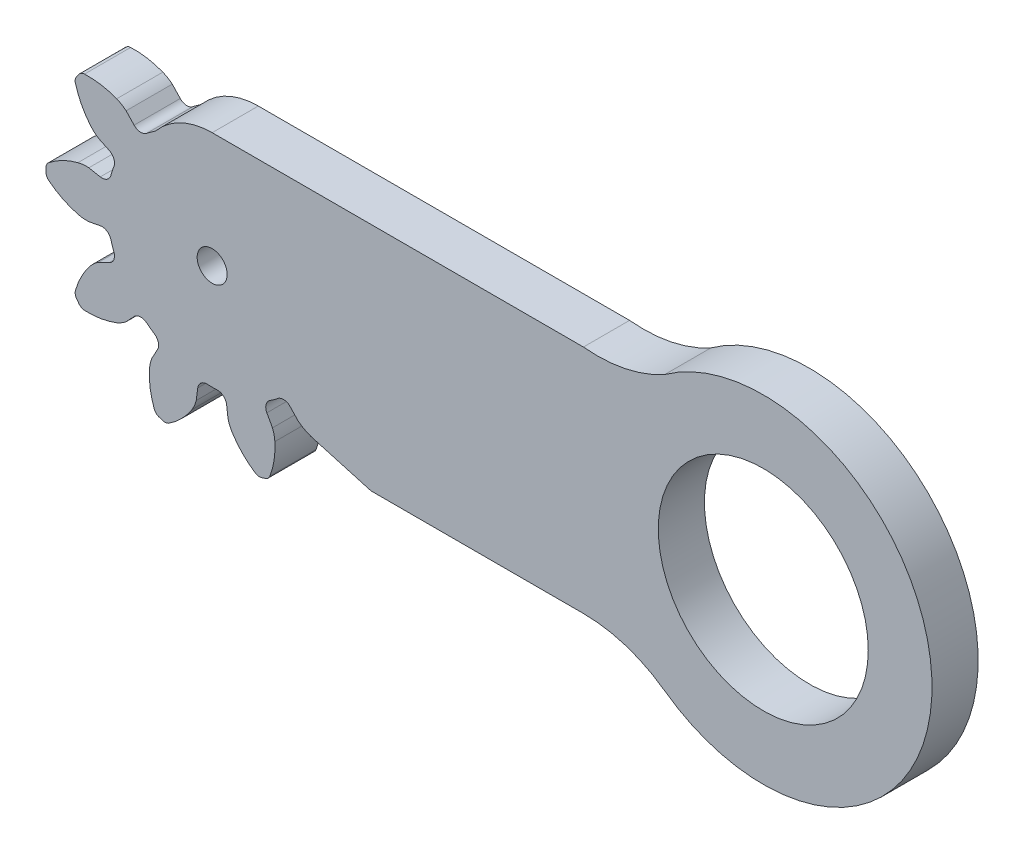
ISO-10303-21;
HEADER;
FILE_DESCRIPTION(('STEP AP214'),'2;1');
FILE_NAME('part.step','',(''),(''),'','','');
FILE_SCHEMA(('AUTOMOTIVE_DESIGN { 1 0 10303 214 1 1 1 1 }'));
ENDSEC;
DATA;
#1=APPLICATION_CONTEXT('core data for automotive mechanical design processes');
#2=APPLICATION_PROTOCOL_DEFINITION('international standard','automotive_design',2000,#1);
#3=PRODUCT_CONTEXT('',#1,'mechanical');
#4=PRODUCT('Part','Part','',(#3));
#5=PRODUCT_RELATED_PRODUCT_CATEGORY('part','',(#4));
#6=PRODUCT_DEFINITION_FORMATION('','',#4);
#7=PRODUCT_DEFINITION_CONTEXT('part definition',#1,'design');
#8=PRODUCT_DEFINITION('design','',#6,#7);
#9=PRODUCT_DEFINITION_SHAPE('','',#8);
#10=(LENGTH_UNIT() NAMED_UNIT(*) SI_UNIT(.MILLI.,.METRE.));
#11=(NAMED_UNIT(*) PLANE_ANGLE_UNIT() SI_UNIT($,.RADIAN.));
#12=(NAMED_UNIT(*) SI_UNIT($,.STERADIAN.) SOLID_ANGLE_UNIT());
#13=UNCERTAINTY_MEASURE_WITH_UNIT(LENGTH_MEASURE(1.E-05),#10,'distance_accuracy_value','');
#14=(GEOMETRIC_REPRESENTATION_CONTEXT(3) GLOBAL_UNCERTAINTY_ASSIGNED_CONTEXT((#13)) GLOBAL_UNIT_ASSIGNED_CONTEXT((#10,
#11,#12)) REPRESENTATION_CONTEXT('',''));
#15=CARTESIAN_POINT('',(0.,0.,0.));
#16=DIRECTION('',(0.,0.,1.));
#17=DIRECTION('',(1.,0.,0.));
#18=AXIS2_PLACEMENT_3D('',#15,#16,#17);
#19=CARTESIAN_POINT('',(-103.947661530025,-18.2969252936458,0.));
#20=DIRECTION('',(0.,0.,1.));
#21=DIRECTION('',(1.,0.,0.));
#22=AXIS2_PLACEMENT_3D('',#19,#20,#21);
#23=PLANE('',#22);
#24=CARTESIAN_POINT('',(0.,0.,0.));
#25=DIRECTION('',(0.,0.,1.));
#26=DIRECTION('',(1.,0.,0.));
#27=AXIS2_PLACEMENT_3D('',#24,#25,#26);
#28=CIRCLE('',#27,22.7500007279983);
#29=CARTESIAN_POINT('',(22.7500007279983,0.,0.));
#30=VERTEX_POINT('',#29);
#31=EDGE_CURVE('E1271',#30,#30,#28,.T.);
#32=ORIENTED_EDGE('',*,*,#31,.T.);
#33=EDGE_LOOP('',(#32));
#34=FACE_BOUND('',#33,.T.);
#35=CARTESIAN_POINT('',(-103.947661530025,-18.2969252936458,0.));
#36=DIRECTION('',(0.,0.,-1.));
#37=DIRECTION('',(1.,0.,0.));
#38=AXIS2_PLACEMENT_3D('',#35,#36,#37);
#39=CIRCLE('',#38,2.00000006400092);
#40=CARTESIAN_POINT('',(-105.196647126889,-16.734864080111,0.));
#41=VERTEX_POINT('',#40);
#42=CARTESIAN_POINT('',(-102.492261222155,-16.9251344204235,0.));
#43=VERTEX_POINT('',#42);
#44=EDGE_CURVE('E545',#41,#43,#39,.T.);
#45=ORIENTED_EDGE('',*,*,#44,.F.);
#46=CARTESIAN_POINT('',(-119.403358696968,1.03295739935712,0.));
#47=DIRECTION('',(0.,0.,1.));
#48=DIRECTION('',(1.,0.,0.));
#49=AXIS2_PLACEMENT_3D('',#46,#47,#48);
#50=CIRCLE('',#49,22.7492007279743);
#51=CARTESIAN_POINT('',(-106.895271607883,-17.9689870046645,0.));
#52=VERTEX_POINT('',#51);
#53=EDGE_CURVE('E296',#52,#41,#50,.T.);
#54=ORIENTED_EDGE('',*,*,#53,.F.);
#55=CARTESIAN_POINT('',(-105.79562088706,-19.6395463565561,0.));
#56=DIRECTION('',(0.,0.,-1.));
#57=DIRECTION('',(1.,0.,0.));
#58=AXIS2_PLACEMENT_3D('',#55,#56,#57);
#59=CIRCLE('',#58,2.00000006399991);
#60=CARTESIAN_POINT('',(-107.550014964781,-20.5998076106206,0.));
#61=VERTEX_POINT('',#60);
#62=EDGE_CURVE('E756',#61,#52,#59,.T.);
#63=ORIENTED_EDGE('',*,*,#62,.F.);
#64=DIRECTION('',(-0.480130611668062,0.877197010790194,0.));
#65=VECTOR('',#64,1.);
#66=CARTESIAN_POINT('',(-107.550014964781,-20.5998076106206,0.));
#67=LINE('',#66,#65);
#68=CARTESIAN_POINT('',(-106.339182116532,-22.8119951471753,0.));
#69=VERTEX_POINT('',#68);
#70=EDGE_CURVE('E530',#69,#61,#67,.T.);
#71=ORIENTED_EDGE('',*,*,#70,.F.);
#72=CARTESIAN_POINT('',(-113.195255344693,-25.574820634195,0.));
#73=DIRECTION('',(0.,0.,1.));
#74=DIRECTION('',(1.,0.,0.));
#75=AXIS2_PLACEMENT_3D('',#72,#73,#74);
#76=CIRCLE('',#75,7.39181606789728);
#77=CARTESIAN_POINT('',(-105.816354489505,-25.1380518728,0.));
#78=VERTEX_POINT('',#77);
#79=EDGE_CURVE('E751',#78,#69,#76,.T.);
#80=ORIENTED_EDGE('',*,*,#79,.F.);
#81=CARTESIAN_POINT('',(-122.807275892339,-26.143771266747,0.));
#82=DIRECTION('',(0.,0.,1.));
#83=DIRECTION('',(1.,0.,0.));
#84=AXIS2_PLACEMENT_3D('',#81,#82,#83);
#85=CIRCLE('',#84,17.0206604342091);
#86=CARTESIAN_POINT('',(-106.870378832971,-32.1202412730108,0.));
#87=VERTEX_POINT('',#86);
#88=EDGE_CURVE('E748',#87,#78,#85,.T.);
#89=ORIENTED_EDGE('',*,*,#88,.F.);
#90=CARTESIAN_POINT('',(-108.347189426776,-31.5664249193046,0.));
#91=DIRECTION('',(0.,0.,1.));
#92=DIRECTION('',(1.,0.,0.));
#93=AXIS2_PLACEMENT_3D('',#90,#91,#92);
#94=CIRCLE('',#93,1.57723875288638);
#95=CARTESIAN_POINT('',(-107.803661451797,-33.0470529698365,0.));
#96=VERTEX_POINT('',#95);
#97=EDGE_CURVE('E745',#96,#87,#94,.T.);
#98=ORIENTED_EDGE('',*,*,#97,.F.);
#99=CARTESIAN_POINT('',(-119.403358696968,1.03295739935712,0.));
#100=DIRECTION('',(0.,0.,1.));
#101=DIRECTION('',(1.,0.,0.));
#102=AXIS2_PLACEMENT_3D('',#99,#100,#101);
#103=CIRCLE('',#102,36.0000011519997);
#104=CARTESIAN_POINT('',(-108.755983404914,-33.3564811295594,0.));
#105=VERTEX_POINT('',#104);
#106=EDGE_CURVE('E742',#105,#96,#103,.T.);
#107=ORIENTED_EDGE('',*,*,#106,.F.);
#108=CARTESIAN_POINT('',(-109.18655136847,-31.8391501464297,0.));
#109=DIRECTION('',(0.,0.,1.));
#110=DIRECTION('',(1.,0.,0.));
#111=AXIS2_PLACEMENT_3D('',#108,#109,#110);
#112=CIRCLE('',#111,1.57723875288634);
#113=CARTESIAN_POINT('',(-110.055791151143,-33.1552444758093,0.));
#114=VERTEX_POINT('',#113);
#115=EDGE_CURVE('E739',#114,#105,#112,.T.);
#116=ORIENTED_EDGE('',*,*,#115,.F.);
#117=CARTESIAN_POINT('',(-100.675451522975,-18.9527056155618,0.));
#118=DIRECTION('',(0.,0.,1.));
#119=DIRECTION('',(1.,0.,0.));
#120=AXIS2_PLACEMENT_3D('',#117,#118,#119);
#121=CIRCLE('',#120,17.0206604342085);
#122=CARTESIAN_POINT('',(-115.012542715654,-28.126074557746,0.));
#123=VERTEX_POINT('',#122);
#124=EDGE_CURVE('E736',#123,#114,#121,.T.);
#125=ORIENTED_EDGE('',*,*,#124,.F.);
#126=CARTESIAN_POINT('',(-108.786160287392,-24.1422188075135,0.));
#127=DIRECTION('',(0.,0.,1.));
#128=DIRECTION('',(1.,0.,0.));
#129=AXIS2_PLACEMENT_3D('',#126,#127,#128);
#130=CIRCLE('',#129,7.39181606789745);
#131=CARTESIAN_POINT('',(-115.95678811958,-25.9369447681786,0.));
#132=VERTEX_POINT('',#131);
#133=EDGE_CURVE('E733',#132,#123,#130,.T.);
#134=ORIENTED_EDGE('',*,*,#133,.F.);
#135=DIRECTION('',(0.127169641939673,-0.991880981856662,0.));
#136=VECTOR('',#135,1.);
#137=CARTESIAN_POINT('',(-115.95678811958,-25.9369447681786,0.));
#138=LINE('',#137,#136);
#139=CARTESIAN_POINT('',(-116.277494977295,-23.4355377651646,0.));
#140=VERTEX_POINT('',#139);
#141=EDGE_CURVE('E730',#140,#132,#138,.T.);
#142=ORIENTED_EDGE('',*,*,#141,.F.);
#143=CARTESIAN_POINT('',(-118.261257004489,-23.6898770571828,0.));
#144=DIRECTION('',(0.,0.,-1.));
#145=DIRECTION('',(1.,0.,0.));
#146=AXIS2_PLACEMENT_3D('',#143,#144,#145);
#147=CIRCLE('',#146,2.00000006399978);
#148=CARTESIAN_POINT('',(-118.353551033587,-21.6920076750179,0.));
#149=VERTEX_POINT('',#148);
#150=EDGE_CURVE('E727',#149,#140,#147,.T.);
#151=ORIENTED_EDGE('',*,*,#150,.F.);
#152=CARTESIAN_POINT('',(-119.403358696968,1.03295739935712,0.));
#153=DIRECTION('',(0.,0.,1.));
#154=DIRECTION('',(1.,0.,0.));
#155=AXIS2_PLACEMENT_3D('',#152,#153,#154);
#156=CIRCLE('',#155,22.7492007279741);
#157=CARTESIAN_POINT('',(-120.453166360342,-21.6920076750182,0.));
#158=VERTEX_POINT('',#157);
#159=EDGE_CURVE('E724',#158,#149,#156,.T.);
#160=ORIENTED_EDGE('',*,*,#159,.F.);
#161=CARTESIAN_POINT('',(-120.54546038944,-23.6898770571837,0.));
#162=DIRECTION('',(0.,0.,-1.));
#163=DIRECTION('',(1.,0.,0.));
#164=AXIS2_PLACEMENT_3D('',#161,#162,#163);
#165=CIRCLE('',#164,2.00000006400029);
#166=CARTESIAN_POINT('',(-122.529222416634,-23.4355377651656,0.));
#167=VERTEX_POINT('',#166);
#168=EDGE_CURVE('E721',#167,#158,#165,.T.);
#169=ORIENTED_EDGE('',*,*,#168,.F.);
#170=DIRECTION('',(0.127169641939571,0.991880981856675,0.));
#171=VECTOR('',#170,1.);
#172=CARTESIAN_POINT('',(-122.529222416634,-23.4355377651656,0.));
#173=LINE('',#172,#171);
#174=CARTESIAN_POINT('',(-122.849929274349,-25.936944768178,0.));
#175=VERTEX_POINT('',#174);
#176=EDGE_CURVE('E718',#175,#167,#173,.T.);
#177=ORIENTED_EDGE('',*,*,#176,.F.);
#178=CARTESIAN_POINT('',(-130.020557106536,-24.1422188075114,0.));
#179=DIRECTION('',(0.,0.,1.));
#180=DIRECTION('',(1.,0.,0.));
#181=AXIS2_PLACEMENT_3D('',#178,#179,#180);
#182=CIRCLE('',#181,7.39181606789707);
#183=CARTESIAN_POINT('',(-123.794174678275,-28.1260745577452,0.));
#184=VERTEX_POINT('',#183);
#185=EDGE_CURVE('E715',#184,#175,#182,.T.);
#186=ORIENTED_EDGE('',*,*,#185,.F.);
#187=CARTESIAN_POINT('',(-138.131265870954,-18.9527056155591,0.));
#188=DIRECTION('',(0.,0.,1.));
#189=DIRECTION('',(1.,0.,0.));
#190=AXIS2_PLACEMENT_3D('',#187,#188,#189);
#191=CIRCLE('',#190,17.0206604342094);
#192=CARTESIAN_POINT('',(-128.750926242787,-33.1552444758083,0.));
#193=VERTEX_POINT('',#192);
#194=EDGE_CURVE('E712',#193,#184,#191,.T.);
#195=ORIENTED_EDGE('',*,*,#194,.F.);
#196=CARTESIAN_POINT('',(-129.62016602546,-31.8391501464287,0.));
#197=DIRECTION('',(0.,0.,1.));
#198=DIRECTION('',(1.,0.,0.));
#199=AXIS2_PLACEMENT_3D('',#196,#197,#198);
#200=CIRCLE('',#199,1.57723875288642);
#201=CARTESIAN_POINT('',(-130.050733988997,-33.3564811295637,0.));
#202=VERTEX_POINT('',#201);
#203=EDGE_CURVE('E709',#202,#193,#200,.T.);
#204=ORIENTED_EDGE('',*,*,#203,.F.);
#205=CARTESIAN_POINT('',(-119.403358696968,1.03295739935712,0.));
#206=DIRECTION('',(0.,0.,1.));
#207=DIRECTION('',(1.,0.,0.));
#208=AXIS2_PLACEMENT_3D('',#205,#206,#207);
#209=CIRCLE('',#208,36.0000011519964);
#210=CARTESIAN_POINT('',(-131.003055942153,-33.0470529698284,0.));
#211=VERTEX_POINT('',#210);
#212=EDGE_CURVE('E706',#211,#202,#209,.T.);
#213=ORIENTED_EDGE('',*,*,#212,.F.);
#214=CARTESIAN_POINT('',(-130.459527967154,-31.5664249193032,0.));
#215=DIRECTION('',(0.,0.,1.));
#216=DIRECTION('',(1.,0.,0.));
#217=AXIS2_PLACEMENT_3D('',#214,#215,#216);
#218=CIRCLE('',#217,1.57723875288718);
#219=CARTESIAN_POINT('',(-131.936338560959,-32.1202412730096,0.));
#220=VERTEX_POINT('',#219);
#221=EDGE_CURVE('E703',#220,#211,#218,.T.);
#222=ORIENTED_EDGE('',*,*,#221,.F.);
#223=CARTESIAN_POINT('',(-115.99944150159,-26.1437712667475,0.));
#224=DIRECTION('',(0.,0.,1.));
#225=DIRECTION('',(1.,0.,0.));
#226=AXIS2_PLACEMENT_3D('',#223,#224,#225);
#227=CIRCLE('',#226,17.02066043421);
#228=CARTESIAN_POINT('',(-132.990362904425,-25.1380518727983,0.));
#229=VERTEX_POINT('',#228);
#230=EDGE_CURVE('E700',#229,#220,#227,.T.);
#231=ORIENTED_EDGE('',*,*,#230,.F.);
#232=CARTESIAN_POINT('',(-125.611462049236,-25.5748206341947,0.));
#233=DIRECTION('',(0.,0.,1.));
#234=DIRECTION('',(1.,0.,0.));
#235=AXIS2_PLACEMENT_3D('',#232,#233,#234);
#236=CIRCLE('',#235,7.391816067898);
#237=CARTESIAN_POINT('',(-132.467535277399,-22.8119951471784,0.));
#238=VERTEX_POINT('',#237);
#239=EDGE_CURVE('E697',#238,#229,#236,.T.);
#240=ORIENTED_EDGE('',*,*,#239,.F.);
#241=DIRECTION('',(-0.480130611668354,-0.877197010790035,0.));
#242=VECTOR('',#241,1.);
#243=CARTESIAN_POINT('',(-132.467535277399,-22.8119951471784,0.));
#244=LINE('',#243,#242);
#245=CARTESIAN_POINT('',(-131.256702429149,-20.599807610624,0.));
#246=VERTEX_POINT('',#245);
#247=EDGE_CURVE('E694',#246,#238,#244,.T.);
#248=ORIENTED_EDGE('',*,*,#247,.F.);
#249=CARTESIAN_POINT('',(-133.011096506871,-19.63954635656,0.));
#250=DIRECTION('',(0.,0.,-1.));
#251=DIRECTION('',(1.,0.,0.));
#252=AXIS2_PLACEMENT_3D('',#249,#250,#251);
#253=CIRCLE('',#252,2.00000006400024);
#254=CARTESIAN_POINT('',(-131.911445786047,-17.9689870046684,0.));
#255=VERTEX_POINT('',#254);
#256=EDGE_CURVE('E691',#255,#246,#253,.T.);
#257=ORIENTED_EDGE('',*,*,#256,.F.);
#258=CARTESIAN_POINT('',(-119.403358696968,1.03295739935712,0.));
#259=DIRECTION('',(0.,0.,1.));
#260=DIRECTION('',(1.,0.,0.));
#261=AXIS2_PLACEMENT_3D('',#258,#259,#260);
#262=CIRCLE('',#261,22.749200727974);
#263=CARTESIAN_POINT('',(-133.610070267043,-16.7348640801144,0.));
#264=VERTEX_POINT('',#263);
#265=EDGE_CURVE('E688',#264,#255,#262,.T.);
#266=ORIENTED_EDGE('',*,*,#265,.F.);
#267=CARTESIAN_POINT('',(-134.859055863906,-18.2969252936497,0.));
#268=DIRECTION('',(0.,0.,-1.));
#269=DIRECTION('',(1.,0.,0.));
#270=AXIS2_PLACEMENT_3D('',#267,#268,#269);
#271=CIRCLE('',#270,2.00000006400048);
#272=CARTESIAN_POINT('',(-136.314456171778,-16.9251344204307,0.));
#273=VERTEX_POINT('',#272);
#274=EDGE_CURVE('E685',#273,#264,#271,.T.);
#275=ORIENTED_EDGE('',*,*,#274,.F.);
#276=DIRECTION('',(0.685895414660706,0.727700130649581,0.));
#277=VECTOR('',#276,1.);
#278=CARTESIAN_POINT('',(-136.314456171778,-16.9251344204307,0.));
#279=LINE('',#278,#277);
#280=CARTESIAN_POINT('',(-138.044203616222,-18.7603084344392,0.));
#281=VERTEX_POINT('',#280);
#282=EDGE_CURVE('E682',#281,#273,#279,.T.);
#283=ORIENTED_EDGE('',*,*,#282,.F.);
#284=CARTESIAN_POINT('',(-142.790449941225,-13.0935553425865,0.));
#285=DIRECTION('',(0.,0.,1.));
#286=DIRECTION('',(1.,0.,0.));
#287=AXIS2_PLACEMENT_3D('',#284,#285,#286);
#288=CIRCLE('',#287,7.39181606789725);
#289=CARTESIAN_POINT('',(-140.094852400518,-19.976338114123,0.));
#290=VERTEX_POINT('',#289);
#291=EDGE_CURVE('E679',#290,#281,#288,.T.);
#292=ORIENTED_EDGE('',*,*,#291,.F.);
#293=CARTESIAN_POINT('',(-146.301831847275,-4.12779598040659,0.));
#294=DIRECTION('',(0.,0.,1.));
#295=DIRECTION('',(1.,0.,0.));
#296=AXIS2_PLACEMENT_3D('',#293,#294,#295);
#297=CIRCLE('',#296,17.020660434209);
#298=CARTESIAN_POINT('',(-147.061020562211,-21.1315165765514,0.));
#299=VERTEX_POINT('',#298);
#300=EDGE_CURVE('E676',#299,#290,#297,.T.);
#301=ORIENTED_EDGE('',*,*,#300,.F.);
#302=CARTESIAN_POINT('',(-146.990669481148,-19.5558475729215,0.));
#303=DIRECTION('',(0.,0.,1.));
#304=DIRECTION('',(1.,0.,0.));
#305=AXIS2_PLACEMENT_3D('',#302,#303,#304);
#306=CIRCLE('',#305,1.57723875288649);
#307=CARTESIAN_POINT('',(-148.230871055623,-20.530312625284,0.));
#308=VERTEX_POINT('',#307);
#309=EDGE_CURVE('E673',#308,#299,#306,.T.);
#310=ORIENTED_EDGE('',*,*,#309,.F.);
#311=CARTESIAN_POINT('',(-119.403358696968,1.03295739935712,0.));
#312=DIRECTION('',(0.,0.,1.));
#313=DIRECTION('',(1.,0.,0.));
#314=AXIS2_PLACEMENT_3D('',#311,#312,#313);
#315=CIRCLE('',#314,36.0000011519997);
#316=CARTESIAN_POINT('',(-148.819438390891,-19.7202191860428,0.));
#317=VERTEX_POINT('',#316);
#318=EDGE_CURVE('E670',#317,#308,#315,.T.);
#319=ORIENTED_EDGE('',*,*,#318,.F.);
#320=CARTESIAN_POINT('',(-147.509423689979,-18.8418436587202,0.));
#321=DIRECTION('',(0.,0.,1.));
#322=DIRECTION('',(1.,0.,0.));
#323=AXIS2_PLACEMENT_3D('',#320,#321,#322);
#324=CIRCLE('',#323,1.57723875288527);
#325=CARTESIAN_POINT('',(-149.029713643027,-18.4218430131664,0.));
#326=VERTEX_POINT('',#325);
#327=EDGE_CURVE('E667',#326,#317,#324,.T.);
#328=ORIENTED_EDGE('',*,*,#327,.F.);
#329=CARTESIAN_POINT('',(-132.623612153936,-22.9542502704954,0.));
#330=DIRECTION('',(0.,0.,1.));
#331=DIRECTION('',(1.,0.,0.));
#332=AXIS2_PLACEMENT_3D('',#329,#330,#331);
#333=CIRCLE('',#332,17.0206604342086);
#334=CARTESIAN_POINT('',(-145.778409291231,-12.1535931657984,0.));
#335=VERTEX_POINT('',#334);
#336=EDGE_CURVE('E664',#335,#326,#333,.T.);
#337=ORIENTED_EDGE('',*,*,#336,.F.);
#338=CARTESIAN_POINT('',(-140.065479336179,-16.8441556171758,0.));
#339=DIRECTION('',(0.,0.,1.));
#340=DIRECTION('',(1.,0.,0.));
#341=AXIS2_PLACEMENT_3D('',#338,#339,#340);
#342=CIRCLE('',#341,7.39181606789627);
#343=CARTESIAN_POINT('',(-143.988211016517,-10.5790841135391,0.));
#344=VERTEX_POINT('',#343);
#345=EDGE_CURVE('E661',#344,#335,#342,.T.);
#346=ORIENTED_EDGE('',*,*,#345,.F.);
#347=DIRECTION('',(-0.904037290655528,-0.427453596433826,0.));
#348=VECTOR('',#347,1.);
#349=CARTESIAN_POINT('',(-143.988211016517,-10.5790841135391,0.));
#350=LINE('',#349,#348);
#351=CARTESIAN_POINT('',(-141.708335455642,-9.50109649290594,0.));
#352=VERTEX_POINT('',#351);
#353=EDGE_CURVE('E658',#352,#344,#350,.T.);
#354=ORIENTED_EDGE('',*,*,#353,.F.);
#355=CARTESIAN_POINT('',(-142.563242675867,-7.69302185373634,0.));
#356=DIRECTION('',(0.,0.,-1.));
#357=DIRECTION('',(1.,0.,0.));
#358=AXIS2_PLACEMENT_3D('',#355,#356,#357);
#359=CIRCLE('',#358,2.00000006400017);
#360=CARTESIAN_POINT('',(-140.691676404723,-6.98786942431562,0.));
#361=VERTEX_POINT('',#360);
#362=EDGE_CURVE('E655',#361,#352,#359,.T.);
#363=ORIENTED_EDGE('',*,*,#362,.F.);
#364=CARTESIAN_POINT('',(-119.403358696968,1.03295739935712,0.));
#365=DIRECTION('',(0.,0.,1.));
#366=DIRECTION('',(1.,0.,0.));
#367=AXIS2_PLACEMENT_3D('',#364,#365,#366);
#368=CIRCLE('',#367,22.7492007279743);
#369=CARTESIAN_POINT('',(-141.340493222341,-4.99101658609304,0.));
#370=VERTEX_POINT('',#369);
#371=EDGE_CURVE('E652',#370,#361,#368,.T.);
#372=ORIENTED_EDGE('',*,*,#371,.F.);
#373=CARTESIAN_POINT('',(-143.269100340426,-5.52061533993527,0.));
#374=DIRECTION('',(0.,0.,-1.));
#375=DIRECTION('',(1.,0.,0.));
#376=AXIS2_PLACEMENT_3D('',#373,#374,#375);
#377=CIRCLE('',#376,2.00000006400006);
#378=CARTESIAN_POINT('',(-143.640225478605,-3.55535037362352,0.));
#379=VERTEX_POINT('',#378);
#380=EDGE_CURVE('E649',#379,#370,#377,.T.);
#381=ORIENTED_EDGE('',*,*,#380,.F.);
#382=DIRECTION('',(0.982632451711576,0.185562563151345,0.));
#383=VECTOR('',#382,1.);
#384=CARTESIAN_POINT('',(-143.640225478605,-3.55535037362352,0.));
#385=LINE('',#384,#383);
#386=CARTESIAN_POINT('',(-146.118308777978,-4.02331730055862,0.));
#387=VERTEX_POINT('',#386);
#388=EDGE_CURVE('E646',#387,#379,#385,.T.);
#389=ORIENTED_EDGE('',*,*,#388,.F.);
#390=CARTESIAN_POINT('',(-146.627268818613,3.35095584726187,0.));
#391=DIRECTION('',(0.,0.,1.));
#392=DIRECTION('',(1.,0.,0.));
#393=AXIS2_PLACEMENT_3D('',#390,#391,#392);
#394=CIRCLE('',#393,7.39181606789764);
#395=CARTESIAN_POINT('',(-148.492082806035,-3.80176486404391,0.));
#396=VERTEX_POINT('',#395);
#397=EDGE_CURVE('E643',#396,#387,#394,.T.);
#398=ORIENTED_EDGE('',*,*,#397,.F.);
#399=CARTESIAN_POINT('',(-144.198095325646,12.6683460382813,0.));
#400=DIRECTION('',(0.,0.,1.));
#401=DIRECTION('',(1.,0.,0.));
#402=AXIS2_PLACEMENT_3D('',#399,#400,#401);
#403=CIRCLE('',#402,17.0206604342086);
#404=CARTESIAN_POINT('',(-154.806828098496,-0.641712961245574,0.));
#405=VERTEX_POINT('',#404);
#406=EDGE_CURVE('E640',#405,#396,#403,.T.);
#407=ORIENTED_EDGE('',*,*,#406,.F.);
#408=CARTESIAN_POINT('',(-153.823757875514,0.591678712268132,0.));
#409=DIRECTION('',(0.,0.,1.));
#410=DIRECTION('',(1.,0.,0.));
#411=AXIS2_PLACEMENT_3D('',#408,#409,#410);
#412=CIRCLE('',#411,1.57723875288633);
#413=CARTESIAN_POINT('',(-155.399878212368,0.532292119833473,0.));
#414=VERTEX_POINT('',#413);
#415=EDGE_CURVE('E637',#414,#405,#412,.T.);
#416=ORIENTED_EDGE('',*,*,#415,.F.);
#417=CARTESIAN_POINT('',(-119.403358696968,1.03295739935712,0.));
#418=DIRECTION('',(0.,0.,1.));
#419=DIRECTION('',(1.,0.,0.));
#420=AXIS2_PLACEMENT_3D('',#417,#418,#419);
#421=CIRCLE('',#420,36.0000011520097);
#422=CARTESIAN_POINT('',(-155.399878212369,1.53362267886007,0.));
#423=VERTEX_POINT('',#422);
#424=EDGE_CURVE('E634',#423,#414,#421,.T.);
#425=ORIENTED_EDGE('',*,*,#424,.F.);
#426=CARTESIAN_POINT('',(-153.823757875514,1.47423608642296,0.));
#427=DIRECTION('',(0.,0.,1.));
#428=DIRECTION('',(1.,0.,0.));
#429=AXIS2_PLACEMENT_3D('',#426,#427,#428);
#430=CIRCLE('',#429,1.57723875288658);
#431=CARTESIAN_POINT('',(-154.806828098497,2.70762775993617,0.));
#432=VERTEX_POINT('',#431);
#433=EDGE_CURVE('E631',#432,#423,#430,.T.);
#434=ORIENTED_EDGE('',*,*,#433,.F.);
#435=CARTESIAN_POINT('',(-144.198095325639,-10.6024312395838,0.));
#436=DIRECTION('',(0.,0.,1.));
#437=DIRECTION('',(1.,0.,0.));
#438=AXIS2_PLACEMENT_3D('',#435,#436,#437);
#439=CIRCLE('',#438,17.0206604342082);
#440=CARTESIAN_POINT('',(-148.492082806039,5.86767966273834,0.));
#441=VERTEX_POINT('',#440);
#442=EDGE_CURVE('E628',#441,#432,#439,.T.);
#443=ORIENTED_EDGE('',*,*,#442,.F.);
#444=CARTESIAN_POINT('',(-146.627268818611,-1.28504104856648,0.));
#445=DIRECTION('',(0.,0.,1.));
#446=DIRECTION('',(1.,0.,0.));
#447=AXIS2_PLACEMENT_3D('',#444,#445,#446);
#448=CIRCLE('',#447,7.391816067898);
#449=CARTESIAN_POINT('',(-146.11830877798,6.08923209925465,0.));
#450=VERTEX_POINT('',#449);
#451=EDGE_CURVE('E625',#450,#441,#448,.T.);
#452=ORIENTED_EDGE('',*,*,#451,.F.);
#453=DIRECTION('',(-0.982632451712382,0.18556256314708,0.));
#454=VECTOR('',#453,1.);
#455=CARTESIAN_POINT('',(-146.11830877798,6.08923209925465,0.));
#456=LINE('',#455,#454);
#457=CARTESIAN_POINT('',(-143.640225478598,5.62126517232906,0.));
#458=VERTEX_POINT('',#457);
#459=EDGE_CURVE('E622',#458,#450,#456,.T.);
#460=ORIENTED_EDGE('',*,*,#459,.F.);
#461=CARTESIAN_POINT('',(-143.269100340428,7.58653013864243,0.));
#462=DIRECTION('',(0.,0.,-1.));
#463=DIRECTION('',(1.,0.,0.));
#464=AXIS2_PLACEMENT_3D('',#461,#462,#463);
#465=CIRCLE('',#464,2.00000006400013);
#466=CARTESIAN_POINT('',(-141.340493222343,7.05693138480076,0.));
#467=VERTEX_POINT('',#466);
#468=EDGE_CURVE('E619',#467,#458,#465,.T.);
#469=ORIENTED_EDGE('',*,*,#468,.F.);
#470=CARTESIAN_POINT('',(-119.403358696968,1.03295739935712,0.));
#471=DIRECTION('',(0.,0.,1.));
#472=DIRECTION('',(1.,0.,0.));
#473=AXIS2_PLACEMENT_3D('',#470,#471,#472);
#474=CIRCLE('',#473,22.7492007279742);
#475=CARTESIAN_POINT('',(-140.691676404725,9.05378422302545,0.));
#476=VERTEX_POINT('',#475);
#477=EDGE_CURVE('E616',#476,#467,#474,.T.);
#478=ORIENTED_EDGE('',*,*,#477,.F.);
#479=CARTESIAN_POINT('',(-142.563242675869,9.75893665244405,0.));
#480=DIRECTION('',(0.,0.,-1.));
#481=DIRECTION('',(1.,0.,0.));
#482=AXIS2_PLACEMENT_3D('',#479,#480,#481);
#483=CIRCLE('',#482,2.00000006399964);
#484=CARTESIAN_POINT('',(-141.708335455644,11.5670112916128,0.));
#485=VERTEX_POINT('',#484);
#486=EDGE_CURVE('E613',#485,#476,#483,.T.);
#487=ORIENTED_EDGE('',*,*,#486,.F.);
#488=DIRECTION('',(0.904037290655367,-0.427453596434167,0.));
#489=VECTOR('',#488,1.);
#490=CARTESIAN_POINT('',(-141.708335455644,11.5670112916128,0.));
#491=LINE('',#490,#489);
#492=CARTESIAN_POINT('',(-143.988211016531,12.6449989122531,0.));
#493=VERTEX_POINT('',#492);
#494=EDGE_CURVE('E610',#493,#485,#491,.T.);
#495=ORIENTED_EDGE('',*,*,#494,.F.);
#496=CARTESIAN_POINT('',(-140.0654793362,18.9100704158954,0.));
#497=DIRECTION('',(0.,0.,1.));
#498=DIRECTION('',(1.,0.,0.));
#499=AXIS2_PLACEMENT_3D('',#496,#497,#498);
#500=CIRCLE('',#499,7.39181606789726);
#501=CARTESIAN_POINT('',(-145.778409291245,14.219507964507,0.));
#502=VERTEX_POINT('',#501);
#503=EDGE_CURVE('E607',#502,#493,#500,.T.);
#504=ORIENTED_EDGE('',*,*,#503,.F.);
#505=CARTESIAN_POINT('',(-132.623612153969,25.0201650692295,0.));
#506=DIRECTION('',(0.,0.,1.));
#507=DIRECTION('',(1.,0.,0.));
#508=AXIS2_PLACEMENT_3D('',#505,#506,#507);
#509=CIRCLE('',#508,17.0206604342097);
#510=CARTESIAN_POINT('',(-149.029713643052,20.487757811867,0.));
#511=VERTEX_POINT('',#510);
#512=EDGE_CURVE('E604',#511,#502,#509,.T.);
#513=ORIENTED_EDGE('',*,*,#512,.F.);
#514=CARTESIAN_POINT('',(-147.509423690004,20.907758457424,0.));
#515=DIRECTION('',(0.,0.,1.));
#516=DIRECTION('',(1.,0.,0.));
#517=AXIS2_PLACEMENT_3D('',#514,#515,#516);
#518=CIRCLE('',#517,1.57723875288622);
#519=CARTESIAN_POINT('',(-148.819438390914,21.7861339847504,0.));
#520=VERTEX_POINT('',#519);
#521=EDGE_CURVE('E601',#520,#511,#518,.T.);
#522=ORIENTED_EDGE('',*,*,#521,.F.);
#523=CARTESIAN_POINT('',(-119.403358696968,1.03295739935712,0.));
#524=DIRECTION('',(0.,0.,1.));
#525=DIRECTION('',(1.,0.,0.));
#526=AXIS2_PLACEMENT_3D('',#523,#524,#525);
#527=CIRCLE('',#526,36.000001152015);
#528=CARTESIAN_POINT('',(-148.230871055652,22.5962274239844,0.));
#529=VERTEX_POINT('',#528);
#530=EDGE_CURVE('E598',#529,#520,#527,.T.);
#531=ORIENTED_EDGE('',*,*,#530,.F.);
#532=CARTESIAN_POINT('',(-146.990669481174,21.6217623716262,0.));
#533=DIRECTION('',(0.,0.,1.));
#534=DIRECTION('',(1.,0.,0.));
#535=AXIS2_PLACEMENT_3D('',#532,#533,#534);
#536=CIRCLE('',#535,1.57723875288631);
#537=CARTESIAN_POINT('',(-147.06102056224,23.1974313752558,0.));
#538=VERTEX_POINT('',#537);
#539=EDGE_CURVE('E595',#538,#529,#536,.T.);
#540=ORIENTED_EDGE('',*,*,#539,.F.);
#541=CARTESIAN_POINT('',(-146.301831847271,6.19371077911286,0.));
#542=DIRECTION('',(0.,0.,1.));
#543=DIRECTION('',(1.,0.,0.));
#544=AXIS2_PLACEMENT_3D('',#541,#542,#543);
#545=CIRCLE('',#544,17.0206604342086);
#546=CARTESIAN_POINT('',(-140.094852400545,22.0422529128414,0.));
#547=VERTEX_POINT('',#546);
#548=EDGE_CURVE('E592',#547,#538,#545,.T.);
#549=ORIENTED_EDGE('',*,*,#548,.F.);
#550=CARTESIAN_POINT('',(-142.790449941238,15.1594701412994,0.));
#551=DIRECTION('',(0.,0.,1.));
#552=DIRECTION('',(1.,0.,0.));
#553=AXIS2_PLACEMENT_3D('',#550,#551,#552);
#554=CIRCLE('',#553,7.39181606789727);
#555=CARTESIAN_POINT('',(-138.044203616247,20.8262232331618,0.));
#556=VERTEX_POINT('',#555);
#557=EDGE_CURVE('E589',#556,#547,#554,.T.);
#558=ORIENTED_EDGE('',*,*,#557,.F.);
#559=DIRECTION('',(-0.685895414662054,0.727700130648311,0.));
#560=VECTOR('',#559,1.);
#561=CARTESIAN_POINT('',(-138.044203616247,20.8262232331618,0.));
#562=LINE('',#561,#560);
#563=CARTESIAN_POINT('',(-136.314456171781,18.9910492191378,0.));
#564=VERTEX_POINT('',#563);
#565=EDGE_CURVE('E586',#564,#556,#562,.T.);
#566=ORIENTED_EDGE('',*,*,#565,.F.);
#567=CARTESIAN_POINT('',(-134.859055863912,20.3628400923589,0.));
#568=DIRECTION('',(0.,0.,-1.));
#569=DIRECTION('',(1.,0.,0.));
#570=AXIS2_PLACEMENT_3D('',#567,#568,#569);
#571=CIRCLE('',#570,2.00000006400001);
#572=CARTESIAN_POINT('',(-133.610070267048,18.8007788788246,0.));
#573=VERTEX_POINT('',#572);
#574=EDGE_CURVE('E583',#573,#564,#571,.T.);
#575=ORIENTED_EDGE('',*,*,#574,.F.);
#576=CARTESIAN_POINT('',(-119.403358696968,1.03295739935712,0.));
#577=DIRECTION('',(0.,0.,1.));
#578=DIRECTION('',(1.,0.,0.));
#579=AXIS2_PLACEMENT_3D('',#576,#577,#578);
#580=CIRCLE('',#579,22.7492007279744);
#581=CARTESIAN_POINT('',(-131.91144578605,20.0349018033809,0.));
#582=VERTEX_POINT('',#581);
#583=EDGE_CURVE('E580',#582,#573,#580,.T.);
#584=ORIENTED_EDGE('',*,*,#583,.F.);
#585=CARTESIAN_POINT('',(-133.011096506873,21.7054611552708,0.));
#586=DIRECTION('',(0.,0.,-1.));
#587=DIRECTION('',(1.,0.,0.));
#588=AXIS2_PLACEMENT_3D('',#585,#586,#587);
#589=CIRCLE('',#588,2.00000006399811);
#590=CARTESIAN_POINT('',(-131.481789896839,20.4165773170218,0.));
#591=VERTEX_POINT('',#590);
#592=EDGE_CURVE('E577',#591,#582,#589,.T.);
#593=ORIENTED_EDGE('',*,*,#592,.F.);
#594=CARTESIAN_POINT('',(-119.403358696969,10.2370000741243,0.));
#595=DIRECTION('',(0.,0.,1.));
#596=DIRECTION('',(1.,0.,0.));
#597=AXIS2_PLACEMENT_3D('',#594,#595,#596);
#598=CIRCLE('',#597,15.7959581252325);
#599=CARTESIAN_POINT('',(-119.403358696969,26.0329581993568,0.));
#600=VERTEX_POINT('',#599);
#601=EDGE_CURVE('E574',#600,#591,#598,.T.);
#602=ORIENTED_EDGE('',*,*,#601,.F.);
#603=DIRECTION('',(-1.,0.,0.));
#604=VECTOR('',#603,1.);
#605=CARTESIAN_POINT('',(-119.403358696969,26.0329581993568,0.));
#606=LINE('',#605,#604);
#607=CARTESIAN_POINT('',(-38.9642269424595,26.0329581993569,0.));
#608=VERTEX_POINT('',#607);
#609=EDGE_CURVE('E571',#608,#600,#606,.T.);
#610=ORIENTED_EDGE('',*,*,#609,.F.);
#611=CARTESIAN_POINT('',(-35.9635310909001,55.8825123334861,0.));
#612=DIRECTION('',(0.,0.,-1.));
#613=DIRECTION('',(1.,0.,0.));
#614=AXIS2_PLACEMENT_3D('',#611,#612,#613);
#615=CIRCLE('',#614,30.0000009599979);
#616=CARTESIAN_POINT('',(-21.3501613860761,29.6823313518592,0.));
#617=VERTEX_POINT('',#616);
#618=EDGE_CURVE('E568',#617,#608,#615,.T.);
#619=ORIENTED_EDGE('',*,*,#618,.F.);
#620=CARTESIAN_POINT('',(0.,0.,0.));
#621=DIRECTION('',(0.,0.,1.));
#622=DIRECTION('',(1.,0.,0.));
#623=AXIS2_PLACEMENT_3D('',#620,#621,#622);
#624=CIRCLE('',#623,36.5632354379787);
#625=CARTESIAN_POINT('',(-21.4464976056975,-29.6128000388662,0.));
#626=VERTEX_POINT('',#625);
#627=EDGE_CURVE('E565',#626,#617,#624,.T.);
#628=ORIENTED_EDGE('',*,*,#627,.F.);
#629=CARTESIAN_POINT('',(-38.9642269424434,-53.9670443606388,0.));
#630=DIRECTION('',(0.,0.,-1.));
#631=DIRECTION('',(1.,0.,0.));
#632=AXIS2_PLACEMENT_3D('',#629,#630,#631);
#633=CIRCLE('',#632,30.0000009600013);
#634=CARTESIAN_POINT('',(-38.9642269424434,-23.9670434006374,0.));
#635=VERTEX_POINT('',#634);
#636=EDGE_CURVE('E562',#635,#626,#633,.T.);
#637=ORIENTED_EDGE('',*,*,#636,.F.);
#638=DIRECTION('',(1.,0.,0.));
#639=VECTOR('',#638,1.);
#640=CARTESIAN_POINT('',(-38.9642269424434,-23.9670434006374,0.));
#641=LINE('',#640,#639);
#642=CARTESIAN_POINT('',(-84.9938095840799,-23.9670434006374,0.));
#643=VERTEX_POINT('',#642);
#644=EDGE_CURVE('E559',#643,#635,#641,.T.);
#645=ORIENTED_EDGE('',*,*,#644,.F.);
#646=DIRECTION('',(0.961869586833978,-0.273508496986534,0.));
#647=VECTOR('',#646,1.);
#648=CARTESIAN_POINT('',(-84.9938095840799,-23.9670434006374,0.));
#649=LINE('',#648,#647);
#650=CARTESIAN_POINT('',(-97.0514400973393,-20.5384451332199,0.));
#651=VERTEX_POINT('',#650);
#652=EDGE_CURVE('E556',#651,#643,#649,.T.);
#653=ORIENTED_EDGE('',*,*,#652,.F.);
#654=CARTESIAN_POINT('',(-94.8429007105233,-11.1674156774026,0.));
#655=DIRECTION('',(0.,0.,1.));
#656=DIRECTION('',(1.,0.,0.));
#657=AXIS2_PLACEMENT_3D('',#654,#655,#656);
#658=CIRCLE('',#657,9.62776398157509);
#659=CARTESIAN_POINT('',(-100.762513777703,-18.7603084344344,0.));
#660=VERTEX_POINT('',#659);
#661=EDGE_CURVE('E553',#660,#651,#658,.T.);
#662=ORIENTED_EDGE('',*,*,#661,.F.);
#663=DIRECTION('',(0.68589541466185,-0.727700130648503,0.));
#664=VECTOR('',#663,1.);
#665=CARTESIAN_POINT('',(-100.762513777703,-18.7603084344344,0.));
#666=LINE('',#665,#664);
#667=EDGE_CURVE('E549',#43,#660,#666,.T.);
#668=ORIENTED_EDGE('',*,*,#667,.F.);
#669=EDGE_LOOP('',(#45,#54,#63,#71,#80,#89,#98,#107,#116,#125,#134,#142,#151,#160,#169,#177,
#186,#195,#204,#213,#222,#231,#240,#248,#257,#266,#275,#283,#292,#301,#310,#319,#328,#337,#346,
#354,#363,#372,#381,#389,#398,#407,#416,#425,#434,#443,#452,#460,#469,#478,#487,#495,#504,#513,
#522,#531,#540,#549,#558,#566,#575,#584,#593,#602,#610,#619,#628,#637,#645,#653,#662,#668));
#670=FACE_BOUND('',#669,.T.);
#671=DIRECTION('',(0.866025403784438,0.5,0.));
#672=VECTOR('',#671,1.);
#673=CARTESIAN_POINT('',(-119.403358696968,-4.74054529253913,0.));
#674=LINE('',#673,#672);
#675=CARTESIAN_POINT('',(-119.403358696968,-4.74054529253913,0.));
#676=VERTEX_POINT('',#675);
#677=CARTESIAN_POINT('',(-114.403358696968,-1.85379394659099,0.));
#678=VERTEX_POINT('',#677);
#679=EDGE_CURVE('E62',#676,#678,#674,.T.);
#680=ORIENTED_EDGE('',*,*,#679,.T.);
#681=DIRECTION('',(0.,1.,0.));
#682=VECTOR('',#681,1.);
#683=CARTESIAN_POINT('',(-114.403358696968,-1.85379394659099,0.));
#684=LINE('',#683,#682);
#685=CARTESIAN_POINT('',(-114.403358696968,3.9197087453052,0.));
#686=VERTEX_POINT('',#685);
#687=EDGE_CURVE('E1323',#678,#686,#684,.T.);
#688=ORIENTED_EDGE('',*,*,#687,.T.);
#689=DIRECTION('',(-0.866025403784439,0.499999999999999,0.));
#690=VECTOR('',#689,1.);
#691=CARTESIAN_POINT('',(-114.403358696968,3.9197087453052,0.));
#692=LINE('',#691,#690);
#693=CARTESIAN_POINT('',(-119.403358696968,6.80646009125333,0.));
#694=VERTEX_POINT('',#693);
#695=EDGE_CURVE('E1319',#686,#694,#692,.T.);
#696=ORIENTED_EDGE('',*,*,#695,.T.);
#697=DIRECTION('',(-0.866025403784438,-0.500000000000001,0.));
#698=VECTOR('',#697,1.);
#699=CARTESIAN_POINT('',(-119.403358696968,6.80646009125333,0.));
#700=LINE('',#699,#698);
#701=CARTESIAN_POINT('',(-124.403358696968,3.91970874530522,0.));
#702=VERTEX_POINT('',#701);
#703=EDGE_CURVE('E1315',#694,#702,#700,.T.);
#704=ORIENTED_EDGE('',*,*,#703,.T.);
#705=DIRECTION('',(0.,-1.,0.));
#706=VECTOR('',#705,1.);
#707=CARTESIAN_POINT('',(-124.403358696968,3.91970874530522,0.));
#708=LINE('',#707,#706);
#709=CARTESIAN_POINT('',(-124.403358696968,-1.85379394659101,0.));
#710=VERTEX_POINT('',#709);
#711=EDGE_CURVE('E1311',#702,#710,#708,.T.);
#712=ORIENTED_EDGE('',*,*,#711,.T.);
#713=DIRECTION('',(0.866025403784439,-0.5,0.));
#714=VECTOR('',#713,1.);
#715=CARTESIAN_POINT('',(-124.403358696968,-1.85379394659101,0.));
#716=LINE('',#715,#714);
#717=EDGE_CURVE('E1306',#710,#676,#716,.T.);
#718=ORIENTED_EDGE('',*,*,#717,.T.);
#719=EDGE_LOOP('',(#680,#688,#696,#704,#712,#718));
#720=FACE_BOUND('',#719,.T.);
#721=ADVANCED_FACE('F45',(#34,#670,#720),#23,.F.);
#722=CARTESIAN_POINT('',(-103.947661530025,-18.2969252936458,10.));
#723=DIRECTION('',(0.,0.,1.));
#724=DIRECTION('',(1.,0.,0.));
#725=AXIS2_PLACEMENT_3D('',#722,#723,#724);
#726=PLANE('',#725);
#727=CARTESIAN_POINT('',(-103.947661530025,-18.2969252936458,10.));
#728=DIRECTION('',(0.,0.,-1.));
#729=DIRECTION('',(1.,0.,0.));
#730=AXIS2_PLACEMENT_3D('',#727,#728,#729);
#731=CIRCLE('',#730,2.00000006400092);
#732=CARTESIAN_POINT('',(-105.196647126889,-16.734864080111,10.));
#733=VERTEX_POINT('',#732);
#734=CARTESIAN_POINT('',(-102.492261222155,-16.9251344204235,10.));
#735=VERTEX_POINT('',#734);
#736=EDGE_CURVE('E761',#733,#735,#731,.T.);
#737=ORIENTED_EDGE('',*,*,#736,.T.);
#738=DIRECTION('',(0.68589541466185,-0.727700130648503,0.));
#739=VECTOR('',#738,1.);
#740=CARTESIAN_POINT('',(-100.762513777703,-18.7603084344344,10.));
#741=LINE('',#740,#739);
#742=CARTESIAN_POINT('',(-100.762513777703,-18.7603084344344,10.));
#743=VERTEX_POINT('',#742);
#744=EDGE_CURVE('E304',#735,#743,#741,.T.);
#745=ORIENTED_EDGE('',*,*,#744,.T.);
#746=CARTESIAN_POINT('',(-94.8429007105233,-11.1674156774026,10.));
#747=DIRECTION('',(0.,0.,1.));
#748=DIRECTION('',(1.,0.,0.));
#749=AXIS2_PLACEMENT_3D('',#746,#747,#748);
#750=CIRCLE('',#749,9.62776398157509);
#751=CARTESIAN_POINT('',(-97.0514400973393,-20.5384451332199,10.));
#752=VERTEX_POINT('',#751);
#753=EDGE_CURVE('E1039',#743,#752,#750,.T.);
#754=ORIENTED_EDGE('',*,*,#753,.T.);
#755=DIRECTION('',(0.961869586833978,-0.273508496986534,0.));
#756=VECTOR('',#755,1.);
#757=CARTESIAN_POINT('',(-84.9938095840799,-23.9670434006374,10.));
#758=LINE('',#757,#756);
#759=CARTESIAN_POINT('',(-84.9938095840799,-23.9670434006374,10.));
#760=VERTEX_POINT('',#759);
#761=EDGE_CURVE('E1058',#752,#760,#758,.T.);
#762=ORIENTED_EDGE('',*,*,#761,.T.);
#763=DIRECTION('',(1.,0.,0.));
#764=VECTOR('',#763,1.);
#765=CARTESIAN_POINT('',(-38.9642269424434,-23.9670434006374,10.));
#766=LINE('',#765,#764);
#767=CARTESIAN_POINT('',(-38.9642269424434,-23.9670434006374,10.));
#768=VERTEX_POINT('',#767);
#769=EDGE_CURVE('E1054',#760,#768,#766,.T.);
#770=ORIENTED_EDGE('',*,*,#769,.T.);
#771=CARTESIAN_POINT('',(-38.9642269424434,-53.9670443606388,10.));
#772=DIRECTION('',(0.,0.,-1.));
#773=DIRECTION('',(1.,0.,0.));
#774=AXIS2_PLACEMENT_3D('',#771,#772,#773);
#775=CIRCLE('',#774,30.0000009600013);
#776=CARTESIAN_POINT('',(-21.4464976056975,-29.6128000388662,10.));
#777=VERTEX_POINT('',#776);
#778=EDGE_CURVE('E1057',#768,#777,#775,.T.);
#779=ORIENTED_EDGE('',*,*,#778,.T.);
#780=CARTESIAN_POINT('',(0.,0.,10.));
#781=DIRECTION('',(0.,0.,1.));
#782=DIRECTION('',(1.,0.,0.));
#783=AXIS2_PLACEMENT_3D('',#780,#781,#782);
#784=CIRCLE('',#783,36.5632354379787);
#785=CARTESIAN_POINT('',(-21.3501613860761,29.6823313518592,10.));
#786=VERTEX_POINT('',#785);
#787=EDGE_CURVE('E1062',#777,#786,#784,.T.);
#788=ORIENTED_EDGE('',*,*,#787,.T.);
#789=CARTESIAN_POINT('',(-35.9635310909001,55.8825123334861,10.));
#790=DIRECTION('',(0.,0.,-1.));
#791=DIRECTION('',(1.,0.,0.));
#792=AXIS2_PLACEMENT_3D('',#789,#790,#791);
#793=CIRCLE('',#792,30.0000009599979);
#794=CARTESIAN_POINT('',(-38.9642269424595,26.0329581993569,10.));
#795=VERTEX_POINT('',#794);
#796=EDGE_CURVE('E1069',#786,#795,#793,.T.);
#797=ORIENTED_EDGE('',*,*,#796,.T.);
#798=DIRECTION('',(-1.,0.,0.));
#799=VECTOR('',#798,1.);
#800=CARTESIAN_POINT('',(-119.403358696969,26.0329581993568,10.));
#801=LINE('',#800,#799);
#802=CARTESIAN_POINT('',(-119.403358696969,26.0329581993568,10.));
#803=VERTEX_POINT('',#802);
#804=EDGE_CURVE('E1072',#795,#803,#801,.T.);
#805=ORIENTED_EDGE('',*,*,#804,.T.);
#806=CARTESIAN_POINT('',(-119.403358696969,10.2370000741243,10.));
#807=DIRECTION('',(0.,0.,1.));
#808=DIRECTION('',(1.,0.,0.));
#809=AXIS2_PLACEMENT_3D('',#806,#807,#808);
#810=CIRCLE('',#809,15.7959581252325);
#811=CARTESIAN_POINT('',(-131.481789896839,20.4165773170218,10.));
#812=VERTEX_POINT('',#811);
#813=EDGE_CURVE('E1075',#803,#812,#810,.T.);
#814=ORIENTED_EDGE('',*,*,#813,.T.);
#815=CARTESIAN_POINT('',(-133.011096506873,21.7054611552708,10.));
#816=DIRECTION('',(0.,0.,-1.));
#817=DIRECTION('',(1.,0.,0.));
#818=AXIS2_PLACEMENT_3D('',#815,#816,#817);
#819=CIRCLE('',#818,2.00000006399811);
#820=CARTESIAN_POINT('',(-131.91144578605,20.0349018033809,10.));
#821=VERTEX_POINT('',#820);
#822=EDGE_CURVE('E1078',#812,#821,#819,.T.);
#823=ORIENTED_EDGE('',*,*,#822,.T.);
#824=CARTESIAN_POINT('',(-119.403358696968,1.03295739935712,10.));
#825=DIRECTION('',(0.,0.,1.));
#826=DIRECTION('',(1.,0.,0.));
#827=AXIS2_PLACEMENT_3D('',#824,#825,#826);
#828=CIRCLE('',#827,22.7492007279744);
#829=CARTESIAN_POINT('',(-133.610070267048,18.8007788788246,10.));
#830=VERTEX_POINT('',#829);
#831=EDGE_CURVE('E1081',#821,#830,#828,.T.);
#832=ORIENTED_EDGE('',*,*,#831,.T.);
#833=CARTESIAN_POINT('',(-134.859055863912,20.3628400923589,10.));
#834=DIRECTION('',(0.,0.,-1.));
#835=DIRECTION('',(1.,0.,0.));
#836=AXIS2_PLACEMENT_3D('',#833,#834,#835);
#837=CIRCLE('',#836,2.00000006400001);
#838=CARTESIAN_POINT('',(-136.314456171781,18.9910492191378,10.));
#839=VERTEX_POINT('',#838);
#840=EDGE_CURVE('E1084',#830,#839,#837,.T.);
#841=ORIENTED_EDGE('',*,*,#840,.T.);
#842=DIRECTION('',(-0.685895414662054,0.727700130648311,0.));
#843=VECTOR('',#842,1.);
#844=CARTESIAN_POINT('',(-138.044203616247,20.8262232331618,10.));
#845=LINE('',#844,#843);
#846=CARTESIAN_POINT('',(-138.044203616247,20.8262232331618,10.));
#847=VERTEX_POINT('',#846);
#848=EDGE_CURVE('E1087',#839,#847,#845,.T.);
#849=ORIENTED_EDGE('',*,*,#848,.T.);
#850=CARTESIAN_POINT('',(-142.790449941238,15.1594701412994,10.));
#851=DIRECTION('',(0.,0.,1.));
#852=DIRECTION('',(1.,0.,0.));
#853=AXIS2_PLACEMENT_3D('',#850,#851,#852);
#854=CIRCLE('',#853,7.39181606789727);
#855=CARTESIAN_POINT('',(-140.094852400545,22.0422529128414,10.));
#856=VERTEX_POINT('',#855);
#857=EDGE_CURVE('E1090',#847,#856,#854,.T.);
#858=ORIENTED_EDGE('',*,*,#857,.T.);
#859=CARTESIAN_POINT('',(-146.301831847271,6.19371077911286,10.));
#860=DIRECTION('',(0.,0.,1.));
#861=DIRECTION('',(1.,0.,0.));
#862=AXIS2_PLACEMENT_3D('',#859,#860,#861);
#863=CIRCLE('',#862,17.0206604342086);
#864=CARTESIAN_POINT('',(-147.06102056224,23.1974313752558,10.));
#865=VERTEX_POINT('',#864);
#866=EDGE_CURVE('E1093',#856,#865,#863,.T.);
#867=ORIENTED_EDGE('',*,*,#866,.T.);
#868=CARTESIAN_POINT('',(-146.990669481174,21.6217623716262,10.));
#869=DIRECTION('',(0.,0.,1.));
#870=DIRECTION('',(1.,0.,0.));
#871=AXIS2_PLACEMENT_3D('',#868,#869,#870);
#872=CIRCLE('',#871,1.57723875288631);
#873=CARTESIAN_POINT('',(-148.230871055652,22.5962274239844,10.));
#874=VERTEX_POINT('',#873);
#875=EDGE_CURVE('E1096',#865,#874,#872,.T.);
#876=ORIENTED_EDGE('',*,*,#875,.T.);
#877=CARTESIAN_POINT('',(-119.403358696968,1.03295739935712,10.));
#878=DIRECTION('',(0.,0.,1.));
#879=DIRECTION('',(1.,0.,0.));
#880=AXIS2_PLACEMENT_3D('',#877,#878,#879);
#881=CIRCLE('',#880,36.000001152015);
#882=CARTESIAN_POINT('',(-148.819438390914,21.7861339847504,10.));
#883=VERTEX_POINT('',#882);
#884=EDGE_CURVE('E1099',#874,#883,#881,.T.);
#885=ORIENTED_EDGE('',*,*,#884,.T.);
#886=CARTESIAN_POINT('',(-147.509423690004,20.907758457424,10.));
#887=DIRECTION('',(0.,0.,1.));
#888=DIRECTION('',(1.,0.,0.));
#889=AXIS2_PLACEMENT_3D('',#886,#887,#888);
#890=CIRCLE('',#889,1.57723875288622);
#891=CARTESIAN_POINT('',(-149.029713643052,20.487757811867,10.));
#892=VERTEX_POINT('',#891);
#893=EDGE_CURVE('E1102',#883,#892,#890,.T.);
#894=ORIENTED_EDGE('',*,*,#893,.T.);
#895=CARTESIAN_POINT('',(-132.623612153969,25.0201650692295,10.));
#896=DIRECTION('',(0.,0.,1.));
#897=DIRECTION('',(1.,0.,0.));
#898=AXIS2_PLACEMENT_3D('',#895,#896,#897);
#899=CIRCLE('',#898,17.0206604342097);
#900=CARTESIAN_POINT('',(-145.778409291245,14.219507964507,10.));
#901=VERTEX_POINT('',#900);
#902=EDGE_CURVE('E1105',#892,#901,#899,.T.);
#903=ORIENTED_EDGE('',*,*,#902,.T.);
#904=CARTESIAN_POINT('',(-140.0654793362,18.9100704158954,10.));
#905=DIRECTION('',(0.,0.,1.));
#906=DIRECTION('',(1.,0.,0.));
#907=AXIS2_PLACEMENT_3D('',#904,#905,#906);
#908=CIRCLE('',#907,7.39181606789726);
#909=CARTESIAN_POINT('',(-143.988211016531,12.6449989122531,10.));
#910=VERTEX_POINT('',#909);
#911=EDGE_CURVE('E1108',#901,#910,#908,.T.);
#912=ORIENTED_EDGE('',*,*,#911,.T.);
#913=DIRECTION('',(0.904037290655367,-0.427453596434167,0.));
#914=VECTOR('',#913,1.);
#915=CARTESIAN_POINT('',(-141.708335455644,11.5670112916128,10.));
#916=LINE('',#915,#914);
#917=CARTESIAN_POINT('',(-141.708335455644,11.5670112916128,10.));
#918=VERTEX_POINT('',#917);
#919=EDGE_CURVE('E1111',#910,#918,#916,.T.);
#920=ORIENTED_EDGE('',*,*,#919,.T.);
#921=CARTESIAN_POINT('',(-142.563242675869,9.75893665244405,10.));
#922=DIRECTION('',(0.,0.,-1.));
#923=DIRECTION('',(1.,0.,0.));
#924=AXIS2_PLACEMENT_3D('',#921,#922,#923);
#925=CIRCLE('',#924,2.00000006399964);
#926=CARTESIAN_POINT('',(-140.691676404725,9.05378422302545,10.));
#927=VERTEX_POINT('',#926);
#928=EDGE_CURVE('E1114',#918,#927,#925,.T.);
#929=ORIENTED_EDGE('',*,*,#928,.T.);
#930=CARTESIAN_POINT('',(-119.403358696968,1.03295739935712,10.));
#931=DIRECTION('',(0.,0.,1.));
#932=DIRECTION('',(1.,0.,0.));
#933=AXIS2_PLACEMENT_3D('',#930,#931,#932);
#934=CIRCLE('',#933,22.7492007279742);
#935=CARTESIAN_POINT('',(-141.340493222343,7.05693138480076,10.));
#936=VERTEX_POINT('',#935);
#937=EDGE_CURVE('E1117',#927,#936,#934,.T.);
#938=ORIENTED_EDGE('',*,*,#937,.T.);
#939=CARTESIAN_POINT('',(-143.269100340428,7.58653013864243,10.));
#940=DIRECTION('',(0.,0.,-1.));
#941=DIRECTION('',(1.,0.,0.));
#942=AXIS2_PLACEMENT_3D('',#939,#940,#941);
#943=CIRCLE('',#942,2.00000006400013);
#944=CARTESIAN_POINT('',(-143.640225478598,5.62126517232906,10.));
#945=VERTEX_POINT('',#944);
#946=EDGE_CURVE('E1120',#936,#945,#943,.T.);
#947=ORIENTED_EDGE('',*,*,#946,.T.);
#948=DIRECTION('',(-0.982632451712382,0.18556256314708,0.));
#949=VECTOR('',#948,1.);
#950=CARTESIAN_POINT('',(-146.11830877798,6.08923209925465,10.));
#951=LINE('',#950,#949);
#952=CARTESIAN_POINT('',(-146.11830877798,6.08923209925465,10.));
#953=VERTEX_POINT('',#952);
#954=EDGE_CURVE('E1123',#945,#953,#951,.T.);
#955=ORIENTED_EDGE('',*,*,#954,.T.);
#956=CARTESIAN_POINT('',(-146.627268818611,-1.28504104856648,10.));
#957=DIRECTION('',(0.,0.,1.));
#958=DIRECTION('',(1.,0.,0.));
#959=AXIS2_PLACEMENT_3D('',#956,#957,#958);
#960=CIRCLE('',#959,7.391816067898);
#961=CARTESIAN_POINT('',(-148.492082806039,5.86767966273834,10.));
#962=VERTEX_POINT('',#961);
#963=EDGE_CURVE('E1126',#953,#962,#960,.T.);
#964=ORIENTED_EDGE('',*,*,#963,.T.);
#965=CARTESIAN_POINT('',(-144.198095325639,-10.6024312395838,10.));
#966=DIRECTION('',(0.,0.,1.));
#967=DIRECTION('',(1.,0.,0.));
#968=AXIS2_PLACEMENT_3D('',#965,#966,#967);
#969=CIRCLE('',#968,17.0206604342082);
#970=CARTESIAN_POINT('',(-154.806828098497,2.70762775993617,10.));
#971=VERTEX_POINT('',#970);
#972=EDGE_CURVE('E1129',#962,#971,#969,.T.);
#973=ORIENTED_EDGE('',*,*,#972,.T.);
#974=CARTESIAN_POINT('',(-153.823757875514,1.47423608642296,10.));
#975=DIRECTION('',(0.,0.,1.));
#976=DIRECTION('',(1.,0.,0.));
#977=AXIS2_PLACEMENT_3D('',#974,#975,#976);
#978=CIRCLE('',#977,1.57723875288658);
#979=CARTESIAN_POINT('',(-155.399878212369,1.53362267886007,10.));
#980=VERTEX_POINT('',#979);
#981=EDGE_CURVE('E1132',#971,#980,#978,.T.);
#982=ORIENTED_EDGE('',*,*,#981,.T.);
#983=CARTESIAN_POINT('',(-119.403358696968,1.03295739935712,10.));
#984=DIRECTION('',(0.,0.,1.));
#985=DIRECTION('',(1.,0.,0.));
#986=AXIS2_PLACEMENT_3D('',#983,#984,#985);
#987=CIRCLE('',#986,36.0000011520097);
#988=CARTESIAN_POINT('',(-155.399878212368,0.532292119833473,10.));
#989=VERTEX_POINT('',#988);
#990=EDGE_CURVE('E1135',#980,#989,#987,.T.);
#991=ORIENTED_EDGE('',*,*,#990,.T.);
#992=CARTESIAN_POINT('',(-153.823757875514,0.591678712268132,10.));
#993=DIRECTION('',(0.,0.,1.));
#994=DIRECTION('',(1.,0.,0.));
#995=AXIS2_PLACEMENT_3D('',#992,#993,#994);
#996=CIRCLE('',#995,1.57723875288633);
#997=CARTESIAN_POINT('',(-154.806828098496,-0.641712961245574,10.));
#998=VERTEX_POINT('',#997);
#999=EDGE_CURVE('E1138',#989,#998,#996,.T.);
#1000=ORIENTED_EDGE('',*,*,#999,.T.);
#1001=CARTESIAN_POINT('',(-144.198095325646,12.6683460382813,10.));
#1002=DIRECTION('',(0.,0.,1.));
#1003=DIRECTION('',(1.,0.,0.));
#1004=AXIS2_PLACEMENT_3D('',#1001,#1002,#1003);
#1005=CIRCLE('',#1004,17.0206604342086);
#1006=CARTESIAN_POINT('',(-148.492082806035,-3.80176486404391,10.));
#1007=VERTEX_POINT('',#1006);
#1008=EDGE_CURVE('E1141',#998,#1007,#1005,.T.);
#1009=ORIENTED_EDGE('',*,*,#1008,.T.);
#1010=CARTESIAN_POINT('',(-146.627268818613,3.35095584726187,10.));
#1011=DIRECTION('',(0.,0.,1.));
#1012=DIRECTION('',(1.,0.,0.));
#1013=AXIS2_PLACEMENT_3D('',#1010,#1011,#1012);
#1014=CIRCLE('',#1013,7.39181606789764);
#1015=CARTESIAN_POINT('',(-146.118308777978,-4.02331730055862,10.));
#1016=VERTEX_POINT('',#1015);
#1017=EDGE_CURVE('E1144',#1007,#1016,#1014,.T.);
#1018=ORIENTED_EDGE('',*,*,#1017,.T.);
#1019=DIRECTION('',(0.982632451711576,0.185562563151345,0.));
#1020=VECTOR('',#1019,1.);
#1021=CARTESIAN_POINT('',(-143.640225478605,-3.55535037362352,10.));
#1022=LINE('',#1021,#1020);
#1023=CARTESIAN_POINT('',(-143.640225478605,-3.55535037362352,10.));
#1024=VERTEX_POINT('',#1023);
#1025=EDGE_CURVE('E1147',#1016,#1024,#1022,.T.);
#1026=ORIENTED_EDGE('',*,*,#1025,.T.);
#1027=CARTESIAN_POINT('',(-143.269100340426,-5.52061533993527,10.));
#1028=DIRECTION('',(0.,0.,-1.));
#1029=DIRECTION('',(1.,0.,0.));
#1030=AXIS2_PLACEMENT_3D('',#1027,#1028,#1029);
#1031=CIRCLE('',#1030,2.00000006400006);
#1032=CARTESIAN_POINT('',(-141.340493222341,-4.99101658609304,10.));
#1033=VERTEX_POINT('',#1032);
#1034=EDGE_CURVE('E1150',#1024,#1033,#1031,.T.);
#1035=ORIENTED_EDGE('',*,*,#1034,.T.);
#1036=CARTESIAN_POINT('',(-119.403358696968,1.03295739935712,10.));
#1037=DIRECTION('',(0.,0.,1.));
#1038=DIRECTION('',(1.,0.,0.));
#1039=AXIS2_PLACEMENT_3D('',#1036,#1037,#1038);
#1040=CIRCLE('',#1039,22.7492007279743);
#1041=CARTESIAN_POINT('',(-140.691676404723,-6.98786942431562,10.));
#1042=VERTEX_POINT('',#1041);
#1043=EDGE_CURVE('E1153',#1033,#1042,#1040,.T.);
#1044=ORIENTED_EDGE('',*,*,#1043,.T.);
#1045=CARTESIAN_POINT('',(-142.563242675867,-7.69302185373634,10.));
#1046=DIRECTION('',(0.,0.,-1.));
#1047=DIRECTION('',(1.,0.,0.));
#1048=AXIS2_PLACEMENT_3D('',#1045,#1046,#1047);
#1049=CIRCLE('',#1048,2.00000006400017);
#1050=CARTESIAN_POINT('',(-141.708335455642,-9.50109649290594,10.));
#1051=VERTEX_POINT('',#1050);
#1052=EDGE_CURVE('E1156',#1042,#1051,#1049,.T.);
#1053=ORIENTED_EDGE('',*,*,#1052,.T.);
#1054=DIRECTION('',(-0.904037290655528,-0.427453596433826,0.));
#1055=VECTOR('',#1054,1.);
#1056=CARTESIAN_POINT('',(-143.988211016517,-10.5790841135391,10.));
#1057=LINE('',#1056,#1055);
#1058=CARTESIAN_POINT('',(-143.988211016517,-10.5790841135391,10.));
#1059=VERTEX_POINT('',#1058);
#1060=EDGE_CURVE('E1159',#1051,#1059,#1057,.T.);
#1061=ORIENTED_EDGE('',*,*,#1060,.T.);
#1062=CARTESIAN_POINT('',(-140.065479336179,-16.8441556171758,10.));
#1063=DIRECTION('',(0.,0.,1.));
#1064=DIRECTION('',(1.,0.,0.));
#1065=AXIS2_PLACEMENT_3D('',#1062,#1063,#1064);
#1066=CIRCLE('',#1065,7.39181606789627);
#1067=CARTESIAN_POINT('',(-145.778409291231,-12.1535931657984,10.));
#1068=VERTEX_POINT('',#1067);
#1069=EDGE_CURVE('E1162',#1059,#1068,#1066,.T.);
#1070=ORIENTED_EDGE('',*,*,#1069,.T.);
#1071=CARTESIAN_POINT('',(-132.623612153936,-22.9542502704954,10.));
#1072=DIRECTION('',(0.,0.,1.));
#1073=DIRECTION('',(1.,0.,0.));
#1074=AXIS2_PLACEMENT_3D('',#1071,#1072,#1073);
#1075=CIRCLE('',#1074,17.0206604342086);
#1076=CARTESIAN_POINT('',(-149.029713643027,-18.4218430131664,10.));
#1077=VERTEX_POINT('',#1076);
#1078=EDGE_CURVE('E1165',#1068,#1077,#1075,.T.);
#1079=ORIENTED_EDGE('',*,*,#1078,.T.);
#1080=CARTESIAN_POINT('',(-147.509423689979,-18.8418436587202,10.));
#1081=DIRECTION('',(0.,0.,1.));
#1082=DIRECTION('',(1.,0.,0.));
#1083=AXIS2_PLACEMENT_3D('',#1080,#1081,#1082);
#1084=CIRCLE('',#1083,1.57723875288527);
#1085=CARTESIAN_POINT('',(-148.819438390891,-19.7202191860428,10.));
#1086=VERTEX_POINT('',#1085);
#1087=EDGE_CURVE('E1168',#1077,#1086,#1084,.T.);
#1088=ORIENTED_EDGE('',*,*,#1087,.T.);
#1089=CARTESIAN_POINT('',(-119.403358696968,1.03295739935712,10.));
#1090=DIRECTION('',(0.,0.,1.));
#1091=DIRECTION('',(1.,0.,0.));
#1092=AXIS2_PLACEMENT_3D('',#1089,#1090,#1091);
#1093=CIRCLE('',#1092,36.0000011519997);
#1094=CARTESIAN_POINT('',(-148.230871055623,-20.530312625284,10.));
#1095=VERTEX_POINT('',#1094);
#1096=EDGE_CURVE('E1171',#1086,#1095,#1093,.T.);
#1097=ORIENTED_EDGE('',*,*,#1096,.T.);
#1098=CARTESIAN_POINT('',(-146.990669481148,-19.5558475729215,10.));
#1099=DIRECTION('',(0.,0.,1.));
#1100=DIRECTION('',(1.,0.,0.));
#1101=AXIS2_PLACEMENT_3D('',#1098,#1099,#1100);
#1102=CIRCLE('',#1101,1.57723875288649);
#1103=CARTESIAN_POINT('',(-147.061020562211,-21.1315165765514,10.));
#1104=VERTEX_POINT('',#1103);
#1105=EDGE_CURVE('E1174',#1095,#1104,#1102,.T.);
#1106=ORIENTED_EDGE('',*,*,#1105,.T.);
#1107=CARTESIAN_POINT('',(-146.301831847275,-4.12779598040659,10.));
#1108=DIRECTION('',(0.,0.,1.));
#1109=DIRECTION('',(1.,0.,0.));
#1110=AXIS2_PLACEMENT_3D('',#1107,#1108,#1109);
#1111=CIRCLE('',#1110,17.020660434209);
#1112=CARTESIAN_POINT('',(-140.094852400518,-19.976338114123,10.));
#1113=VERTEX_POINT('',#1112);
#1114=EDGE_CURVE('E1177',#1104,#1113,#1111,.T.);
#1115=ORIENTED_EDGE('',*,*,#1114,.T.);
#1116=CARTESIAN_POINT('',(-142.790449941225,-13.0935553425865,10.));
#1117=DIRECTION('',(0.,0.,1.));
#1118=DIRECTION('',(1.,0.,0.));
#1119=AXIS2_PLACEMENT_3D('',#1116,#1117,#1118);
#1120=CIRCLE('',#1119,7.39181606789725);
#1121=CARTESIAN_POINT('',(-138.044203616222,-18.7603084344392,10.));
#1122=VERTEX_POINT('',#1121);
#1123=EDGE_CURVE('E1180',#1113,#1122,#1120,.T.);
#1124=ORIENTED_EDGE('',*,*,#1123,.T.);
#1125=DIRECTION('',(0.685895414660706,0.727700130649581,0.));
#1126=VECTOR('',#1125,1.);
#1127=CARTESIAN_POINT('',(-136.314456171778,-16.9251344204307,10.));
#1128=LINE('',#1127,#1126);
#1129=CARTESIAN_POINT('',(-136.314456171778,-16.9251344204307,10.));
#1130=VERTEX_POINT('',#1129);
#1131=EDGE_CURVE('E1183',#1122,#1130,#1128,.T.);
#1132=ORIENTED_EDGE('',*,*,#1131,.T.);
#1133=CARTESIAN_POINT('',(-134.859055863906,-18.2969252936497,10.));
#1134=DIRECTION('',(0.,0.,-1.));
#1135=DIRECTION('',(1.,0.,0.));
#1136=AXIS2_PLACEMENT_3D('',#1133,#1134,#1135);
#1137=CIRCLE('',#1136,2.00000006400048);
#1138=CARTESIAN_POINT('',(-133.610070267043,-16.7348640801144,10.));
#1139=VERTEX_POINT('',#1138);
#1140=EDGE_CURVE('E1186',#1130,#1139,#1137,.T.);
#1141=ORIENTED_EDGE('',*,*,#1140,.T.);
#1142=CARTESIAN_POINT('',(-119.403358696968,1.03295739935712,10.));
#1143=DIRECTION('',(0.,0.,1.));
#1144=DIRECTION('',(1.,0.,0.));
#1145=AXIS2_PLACEMENT_3D('',#1142,#1143,#1144);
#1146=CIRCLE('',#1145,22.749200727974);
#1147=CARTESIAN_POINT('',(-131.911445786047,-17.9689870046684,10.));
#1148=VERTEX_POINT('',#1147);
#1149=EDGE_CURVE('E1189',#1139,#1148,#1146,.T.);
#1150=ORIENTED_EDGE('',*,*,#1149,.T.);
#1151=CARTESIAN_POINT('',(-133.011096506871,-19.63954635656,10.));
#1152=DIRECTION('',(0.,0.,-1.));
#1153=DIRECTION('',(1.,0.,0.));
#1154=AXIS2_PLACEMENT_3D('',#1151,#1152,#1153);
#1155=CIRCLE('',#1154,2.00000006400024);
#1156=CARTESIAN_POINT('',(-131.256702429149,-20.599807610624,10.));
#1157=VERTEX_POINT('',#1156);
#1158=EDGE_CURVE('E1192',#1148,#1157,#1155,.T.);
#1159=ORIENTED_EDGE('',*,*,#1158,.T.);
#1160=DIRECTION('',(-0.480130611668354,-0.877197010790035,0.));
#1161=VECTOR('',#1160,1.);
#1162=CARTESIAN_POINT('',(-132.467535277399,-22.8119951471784,10.));
#1163=LINE('',#1162,#1161);
#1164=CARTESIAN_POINT('',(-132.467535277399,-22.8119951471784,10.));
#1165=VERTEX_POINT('',#1164);
#1166=EDGE_CURVE('E1195',#1157,#1165,#1163,.T.);
#1167=ORIENTED_EDGE('',*,*,#1166,.T.);
#1168=CARTESIAN_POINT('',(-125.611462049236,-25.5748206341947,10.));
#1169=DIRECTION('',(0.,0.,1.));
#1170=DIRECTION('',(1.,0.,0.));
#1171=AXIS2_PLACEMENT_3D('',#1168,#1169,#1170);
#1172=CIRCLE('',#1171,7.391816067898);
#1173=CARTESIAN_POINT('',(-132.990362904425,-25.1380518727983,10.));
#1174=VERTEX_POINT('',#1173);
#1175=EDGE_CURVE('E1198',#1165,#1174,#1172,.T.);
#1176=ORIENTED_EDGE('',*,*,#1175,.T.);
#1177=CARTESIAN_POINT('',(-115.99944150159,-26.1437712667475,10.));
#1178=DIRECTION('',(0.,0.,1.));
#1179=DIRECTION('',(1.,0.,0.));
#1180=AXIS2_PLACEMENT_3D('',#1177,#1178,#1179);
#1181=CIRCLE('',#1180,17.02066043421);
#1182=CARTESIAN_POINT('',(-131.936338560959,-32.1202412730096,10.));
#1183=VERTEX_POINT('',#1182);
#1184=EDGE_CURVE('E1201',#1174,#1183,#1181,.T.);
#1185=ORIENTED_EDGE('',*,*,#1184,.T.);
#1186=CARTESIAN_POINT('',(-130.459527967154,-31.5664249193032,10.));
#1187=DIRECTION('',(0.,0.,1.));
#1188=DIRECTION('',(1.,0.,0.));
#1189=AXIS2_PLACEMENT_3D('',#1186,#1187,#1188);
#1190=CIRCLE('',#1189,1.57723875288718);
#1191=CARTESIAN_POINT('',(-131.003055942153,-33.0470529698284,10.));
#1192=VERTEX_POINT('',#1191);
#1193=EDGE_CURVE('E1204',#1183,#1192,#1190,.T.);
#1194=ORIENTED_EDGE('',*,*,#1193,.T.);
#1195=CARTESIAN_POINT('',(-119.403358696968,1.03295739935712,10.));
#1196=DIRECTION('',(0.,0.,1.));
#1197=DIRECTION('',(1.,0.,0.));
#1198=AXIS2_PLACEMENT_3D('',#1195,#1196,#1197);
#1199=CIRCLE('',#1198,36.0000011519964);
#1200=CARTESIAN_POINT('',(-130.050733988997,-33.3564811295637,10.));
#1201=VERTEX_POINT('',#1200);
#1202=EDGE_CURVE('E1207',#1192,#1201,#1199,.T.);
#1203=ORIENTED_EDGE('',*,*,#1202,.T.);
#1204=CARTESIAN_POINT('',(-129.62016602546,-31.8391501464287,10.));
#1205=DIRECTION('',(0.,0.,1.));
#1206=DIRECTION('',(1.,0.,0.));
#1207=AXIS2_PLACEMENT_3D('',#1204,#1205,#1206);
#1208=CIRCLE('',#1207,1.57723875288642);
#1209=CARTESIAN_POINT('',(-128.750926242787,-33.1552444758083,10.));
#1210=VERTEX_POINT('',#1209);
#1211=EDGE_CURVE('E1210',#1201,#1210,#1208,.T.);
#1212=ORIENTED_EDGE('',*,*,#1211,.T.);
#1213=CARTESIAN_POINT('',(-138.131265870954,-18.9527056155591,10.));
#1214=DIRECTION('',(0.,0.,1.));
#1215=DIRECTION('',(1.,0.,0.));
#1216=AXIS2_PLACEMENT_3D('',#1213,#1214,#1215);
#1217=CIRCLE('',#1216,17.0206604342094);
#1218=CARTESIAN_POINT('',(-123.794174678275,-28.1260745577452,10.));
#1219=VERTEX_POINT('',#1218);
#1220=EDGE_CURVE('E1213',#1210,#1219,#1217,.T.);
#1221=ORIENTED_EDGE('',*,*,#1220,.T.);
#1222=CARTESIAN_POINT('',(-130.020557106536,-24.1422188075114,10.));
#1223=DIRECTION('',(0.,0.,1.));
#1224=DIRECTION('',(1.,0.,0.));
#1225=AXIS2_PLACEMENT_3D('',#1222,#1223,#1224);
#1226=CIRCLE('',#1225,7.39181606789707);
#1227=CARTESIAN_POINT('',(-122.849929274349,-25.936944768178,10.));
#1228=VERTEX_POINT('',#1227);
#1229=EDGE_CURVE('E1216',#1219,#1228,#1226,.T.);
#1230=ORIENTED_EDGE('',*,*,#1229,.T.);
#1231=DIRECTION('',(0.127169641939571,0.991880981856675,0.));
#1232=VECTOR('',#1231,1.);
#1233=CARTESIAN_POINT('',(-122.529222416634,-23.4355377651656,10.));
#1234=LINE('',#1233,#1232);
#1235=CARTESIAN_POINT('',(-122.529222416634,-23.4355377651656,10.));
#1236=VERTEX_POINT('',#1235);
#1237=EDGE_CURVE('E1219',#1228,#1236,#1234,.T.);
#1238=ORIENTED_EDGE('',*,*,#1237,.T.);
#1239=CARTESIAN_POINT('',(-120.54546038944,-23.6898770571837,10.));
#1240=DIRECTION('',(0.,0.,-1.));
#1241=DIRECTION('',(1.,0.,0.));
#1242=AXIS2_PLACEMENT_3D('',#1239,#1240,#1241);
#1243=CIRCLE('',#1242,2.00000006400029);
#1244=CARTESIAN_POINT('',(-120.453166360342,-21.6920076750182,10.));
#1245=VERTEX_POINT('',#1244);
#1246=EDGE_CURVE('E1222',#1236,#1245,#1243,.T.);
#1247=ORIENTED_EDGE('',*,*,#1246,.T.);
#1248=CARTESIAN_POINT('',(-119.403358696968,1.03295739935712,10.));
#1249=DIRECTION('',(0.,0.,1.));
#1250=DIRECTION('',(1.,0.,0.));
#1251=AXIS2_PLACEMENT_3D('',#1248,#1249,#1250);
#1252=CIRCLE('',#1251,22.7492007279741);
#1253=CARTESIAN_POINT('',(-118.353551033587,-21.6920076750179,10.));
#1254=VERTEX_POINT('',#1253);
#1255=EDGE_CURVE('E1225',#1245,#1254,#1252,.T.);
#1256=ORIENTED_EDGE('',*,*,#1255,.T.);
#1257=CARTESIAN_POINT('',(-118.261257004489,-23.6898770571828,10.));
#1258=DIRECTION('',(0.,0.,-1.));
#1259=DIRECTION('',(1.,0.,0.));
#1260=AXIS2_PLACEMENT_3D('',#1257,#1258,#1259);
#1261=CIRCLE('',#1260,2.00000006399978);
#1262=CARTESIAN_POINT('',(-116.277494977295,-23.4355377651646,10.));
#1263=VERTEX_POINT('',#1262);
#1264=EDGE_CURVE('E1228',#1254,#1263,#1261,.T.);
#1265=ORIENTED_EDGE('',*,*,#1264,.T.);
#1266=DIRECTION('',(0.127169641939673,-0.991880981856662,0.));
#1267=VECTOR('',#1266,1.);
#1268=CARTESIAN_POINT('',(-115.95678811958,-25.9369447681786,10.));
#1269=LINE('',#1268,#1267);
#1270=CARTESIAN_POINT('',(-115.95678811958,-25.9369447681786,10.));
#1271=VERTEX_POINT('',#1270);
#1272=EDGE_CURVE('E1231',#1263,#1271,#1269,.T.);
#1273=ORIENTED_EDGE('',*,*,#1272,.T.);
#1274=CARTESIAN_POINT('',(-108.786160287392,-24.1422188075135,10.));
#1275=DIRECTION('',(0.,0.,1.));
#1276=DIRECTION('',(1.,0.,0.));
#1277=AXIS2_PLACEMENT_3D('',#1274,#1275,#1276);
#1278=CIRCLE('',#1277,7.39181606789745);
#1279=CARTESIAN_POINT('',(-115.012542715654,-28.126074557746,10.));
#1280=VERTEX_POINT('',#1279);
#1281=EDGE_CURVE('E1234',#1271,#1280,#1278,.T.);
#1282=ORIENTED_EDGE('',*,*,#1281,.T.);
#1283=CARTESIAN_POINT('',(-100.675451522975,-18.9527056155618,10.));
#1284=DIRECTION('',(0.,0.,1.));
#1285=DIRECTION('',(1.,0.,0.));
#1286=AXIS2_PLACEMENT_3D('',#1283,#1284,#1285);
#1287=CIRCLE('',#1286,17.0206604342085);
#1288=CARTESIAN_POINT('',(-110.055791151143,-33.1552444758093,10.));
#1289=VERTEX_POINT('',#1288);
#1290=EDGE_CURVE('E1237',#1280,#1289,#1287,.T.);
#1291=ORIENTED_EDGE('',*,*,#1290,.T.);
#1292=CARTESIAN_POINT('',(-109.18655136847,-31.8391501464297,10.));
#1293=DIRECTION('',(0.,0.,1.));
#1294=DIRECTION('',(1.,0.,0.));
#1295=AXIS2_PLACEMENT_3D('',#1292,#1293,#1294);
#1296=CIRCLE('',#1295,1.57723875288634);
#1297=CARTESIAN_POINT('',(-108.755983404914,-33.3564811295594,10.));
#1298=VERTEX_POINT('',#1297);
#1299=EDGE_CURVE('E1240',#1289,#1298,#1296,.T.);
#1300=ORIENTED_EDGE('',*,*,#1299,.T.);
#1301=CARTESIAN_POINT('',(-119.403358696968,1.03295739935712,10.));
#1302=DIRECTION('',(0.,0.,1.));
#1303=DIRECTION('',(1.,0.,0.));
#1304=AXIS2_PLACEMENT_3D('',#1301,#1302,#1303);
#1305=CIRCLE('',#1304,36.0000011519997);
#1306=CARTESIAN_POINT('',(-107.803661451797,-33.0470529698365,10.));
#1307=VERTEX_POINT('',#1306);
#1308=EDGE_CURVE('E1243',#1298,#1307,#1305,.T.);
#1309=ORIENTED_EDGE('',*,*,#1308,.T.);
#1310=CARTESIAN_POINT('',(-108.347189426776,-31.5664249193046,10.));
#1311=DIRECTION('',(0.,0.,1.));
#1312=DIRECTION('',(1.,0.,0.));
#1313=AXIS2_PLACEMENT_3D('',#1310,#1311,#1312);
#1314=CIRCLE('',#1313,1.57723875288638);
#1315=CARTESIAN_POINT('',(-106.870378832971,-32.1202412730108,10.));
#1316=VERTEX_POINT('',#1315);
#1317=EDGE_CURVE('E1246',#1307,#1316,#1314,.T.);
#1318=ORIENTED_EDGE('',*,*,#1317,.T.);
#1319=CARTESIAN_POINT('',(-122.807275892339,-26.143771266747,10.));
#1320=DIRECTION('',(0.,0.,1.));
#1321=DIRECTION('',(1.,0.,0.));
#1322=AXIS2_PLACEMENT_3D('',#1319,#1320,#1321);
#1323=CIRCLE('',#1322,17.0206604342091);
#1324=CARTESIAN_POINT('',(-105.816354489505,-25.1380518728,10.));
#1325=VERTEX_POINT('',#1324);
#1326=EDGE_CURVE('E1249',#1316,#1325,#1323,.T.);
#1327=ORIENTED_EDGE('',*,*,#1326,.T.);
#1328=CARTESIAN_POINT('',(-113.195255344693,-25.574820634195,10.));
#1329=DIRECTION('',(0.,0.,1.));
#1330=DIRECTION('',(1.,0.,0.));
#1331=AXIS2_PLACEMENT_3D('',#1328,#1329,#1330);
#1332=CIRCLE('',#1331,7.39181606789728);
#1333=CARTESIAN_POINT('',(-106.339182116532,-22.8119951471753,10.));
#1334=VERTEX_POINT('',#1333);
#1335=EDGE_CURVE('E520',#1325,#1334,#1332,.T.);
#1336=ORIENTED_EDGE('',*,*,#1335,.T.);
#1337=DIRECTION('',(-0.480130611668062,0.877197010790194,0.));
#1338=VECTOR('',#1337,1.);
#1339=CARTESIAN_POINT('',(-107.550014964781,-20.5998076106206,10.));
#1340=LINE('',#1339,#1338);
#1341=CARTESIAN_POINT('',(-107.550014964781,-20.5998076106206,10.));
#1342=VERTEX_POINT('',#1341);
#1343=EDGE_CURVE('E512',#1334,#1342,#1340,.T.);
#1344=ORIENTED_EDGE('',*,*,#1343,.T.);
#1345=CARTESIAN_POINT('',(-105.79562088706,-19.6395463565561,10.));
#1346=DIRECTION('',(0.,0.,-1.));
#1347=DIRECTION('',(1.,0.,0.));
#1348=AXIS2_PLACEMENT_3D('',#1345,#1346,#1347);
#1349=CIRCLE('',#1348,2.00000006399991);
#1350=CARTESIAN_POINT('',(-106.895271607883,-17.9689870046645,10.));
#1351=VERTEX_POINT('',#1350);
#1352=EDGE_CURVE('E517',#1342,#1351,#1349,.T.);
#1353=ORIENTED_EDGE('',*,*,#1352,.T.);
#1354=CARTESIAN_POINT('',(-119.403358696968,1.03295739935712,10.));
#1355=DIRECTION('',(0.,0.,1.));
#1356=DIRECTION('',(1.,0.,0.));
#1357=AXIS2_PLACEMENT_3D('',#1354,#1355,#1356);
#1358=CIRCLE('',#1357,22.7492007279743);
#1359=EDGE_CURVE('E71',#1351,#733,#1358,.T.);
#1360=ORIENTED_EDGE('',*,*,#1359,.T.);
#1361=EDGE_LOOP('',(#737,#745,#754,#762,#770,#779,#788,#797,#805,#814,#823,#832,#841,#849,#858,
#867,#876,#885,#894,#903,#912,#920,#929,#938,#947,#955,#964,#973,#982,#991,#1000,#1009,#1018,
#1026,#1035,#1044,#1053,#1061,#1070,#1079,#1088,#1097,#1106,#1115,#1124,#1132,#1141,#1150,#1159,
#1167,#1176,#1185,#1194,#1203,#1212,#1221,#1230,#1238,#1247,#1256,#1265,#1273,#1282,#1291,#1300,
#1309,#1318,#1327,#1336,#1344,#1353,#1360));
#1362=FACE_BOUND('',#1361,.T.);
#1363=CARTESIAN_POINT('',(0.,0.,10.));
#1364=DIRECTION('',(0.,0.,1.));
#1365=DIRECTION('',(1.,0.,0.));
#1366=AXIS2_PLACEMENT_3D('',#1363,#1364,#1365);
#1367=CIRCLE('',#1366,22.7500007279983);
#1368=CARTESIAN_POINT('',(22.7500007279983,0.,10.));
#1369=VERTEX_POINT('',#1368);
#1370=EDGE_CURVE('E550',#1369,#1369,#1367,.T.);
#1371=ORIENTED_EDGE('',*,*,#1370,.F.);
#1372=EDGE_LOOP('',(#1371));
#1373=FACE_BOUND('',#1372,.T.);
#1374=CARTESIAN_POINT('',(-119.403358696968,1.03295739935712,10.));
#1375=DIRECTION('',(0.,0.,-1.));
#1376=DIRECTION('',(-1.,0.,0.));
#1377=AXIS2_PLACEMENT_3D('',#1374,#1375,#1376);
#1378=CIRCLE('',#1377,3.25000000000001);
#1379=CARTESIAN_POINT('',(-122.653358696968,1.03295739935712,10.));
#1380=VERTEX_POINT('',#1379);
#1381=EDGE_CURVE('E1276',#1380,#1380,#1378,.T.);
#1382=ORIENTED_EDGE('',*,*,#1381,.T.);
#1383=EDGE_LOOP('',(#1382));
#1384=FACE_BOUND('',#1383,.T.);
#1385=ADVANCED_FACE('F514',(#1362,#1373,#1384),#726,.T.);
#1386=CARTESIAN_POINT('',(-103.947661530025,-18.2969252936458,10.));
#1387=DIRECTION('',(0.,0.,-1.));
#1388=DIRECTION('',(-1.,0.,0.));
#1389=AXIS2_PLACEMENT_3D('',#1386,#1387,#1388);
#1390=CYLINDRICAL_SURFACE('',#1389,2.00000006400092);
#1391=ORIENTED_EDGE('',*,*,#44,.T.);
#1392=DIRECTION('',(0.,0.,-1.));
#1393=VECTOR('',#1392,1.);
#1394=CARTESIAN_POINT('',(-102.492261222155,-16.9251344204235,10.));
#1395=LINE('',#1394,#1393);
#1396=EDGE_CURVE('E11',#735,#43,#1395,.T.);
#1397=ORIENTED_EDGE('',*,*,#1396,.F.);
#1398=ORIENTED_EDGE('',*,*,#736,.F.);
#1399=DIRECTION('',(0.,0.,-1.));
#1400=VECTOR('',#1399,1.);
#1401=CARTESIAN_POINT('',(-105.196647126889,-16.734864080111,10.));
#1402=LINE('',#1401,#1400);
#1403=EDGE_CURVE('E541',#733,#41,#1402,.T.);
#1404=ORIENTED_EDGE('',*,*,#1403,.T.);
#1405=EDGE_LOOP('',(#1391,#1397,#1398,#1404));
#1406=FACE_BOUND('',#1405,.T.);
#1407=ADVANCED_FACE('F47',(#1406),#1390,.F.);
#1408=CARTESIAN_POINT('',(-100.762513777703,-18.7603084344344,10.));
#1409=DIRECTION('',(0.727700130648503,0.68589541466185,0.));
#1410=DIRECTION('',(-0.68589541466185,0.727700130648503,0.));
#1411=AXIS2_PLACEMENT_3D('',#1408,#1409,#1410);
#1412=PLANE('',#1411);
#1413=ORIENTED_EDGE('',*,*,#667,.T.);
#1414=DIRECTION('',(0.,0.,-1.));
#1415=VECTOR('',#1414,1.);
#1416=CARTESIAN_POINT('',(-100.762513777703,-18.7603084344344,10.));
#1417=LINE('',#1416,#1415);
#1418=EDGE_CURVE('E55',#743,#660,#1417,.T.);
#1419=ORIENTED_EDGE('',*,*,#1418,.F.);
#1420=ORIENTED_EDGE('',*,*,#744,.F.);
#1421=ORIENTED_EDGE('',*,*,#1396,.T.);
#1422=EDGE_LOOP('',(#1413,#1419,#1420,#1421));
#1423=FACE_BOUND('',#1422,.T.);
#1424=ADVANCED_FACE('F1680',(#1423),#1412,.F.);
#1425=CARTESIAN_POINT('',(-94.8429007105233,-11.1674156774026,10.));
#1426=DIRECTION('',(0.,0.,-1.));
#1427=DIRECTION('',(-1.,0.,0.));
#1428=AXIS2_PLACEMENT_3D('',#1425,#1426,#1427);
#1429=CYLINDRICAL_SURFACE('',#1428,9.62776398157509);
#1430=ORIENTED_EDGE('',*,*,#661,.T.);
#1431=DIRECTION('',(0.,0.,-1.));
#1432=VECTOR('',#1431,1.);
#1433=CARTESIAN_POINT('',(-97.0514400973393,-20.5384451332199,10.));
#1434=LINE('',#1433,#1432);
#1435=EDGE_CURVE('E1028',#752,#651,#1434,.T.);
#1436=ORIENTED_EDGE('',*,*,#1435,.F.);
#1437=ORIENTED_EDGE('',*,*,#753,.F.);
#1438=ORIENTED_EDGE('',*,*,#1418,.T.);
#1439=EDGE_LOOP('',(#1430,#1436,#1437,#1438));
#1440=FACE_BOUND('',#1439,.T.);
#1441=ADVANCED_FACE('F1037',(#1440),#1429,.T.);
#1442=CARTESIAN_POINT('',(-84.9938095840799,-23.9670434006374,10.));
#1443=DIRECTION('',(0.273508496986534,0.961869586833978,0.));
#1444=DIRECTION('',(-0.961869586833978,0.273508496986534,0.));
#1445=AXIS2_PLACEMENT_3D('',#1442,#1443,#1444);
#1446=PLANE('',#1445);
#1447=ORIENTED_EDGE('',*,*,#652,.T.);
#1448=DIRECTION('',(0.,0.,-1.));
#1449=VECTOR('',#1448,1.);
#1450=CARTESIAN_POINT('',(-84.9938095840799,-23.9670434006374,10.));
#1451=LINE('',#1450,#1449);
#1452=EDGE_CURVE('E1024',#760,#643,#1451,.T.);
#1453=ORIENTED_EDGE('',*,*,#1452,.F.);
#1454=ORIENTED_EDGE('',*,*,#761,.F.);
#1455=ORIENTED_EDGE('',*,*,#1435,.T.);
#1456=EDGE_LOOP('',(#1447,#1453,#1454,#1455));
#1457=FACE_BOUND('',#1456,.T.);
#1458=ADVANCED_FACE('F1048',(#1457),#1446,.F.);
#1459=CARTESIAN_POINT('',(-38.9642269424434,-23.9670434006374,10.));
#1460=DIRECTION('',(0.,1.,0.));
#1461=DIRECTION('',(0.,0.,1.));
#1462=AXIS2_PLACEMENT_3D('',#1459,#1460,#1461);
#1463=PLANE('',#1462);
#1464=ORIENTED_EDGE('',*,*,#644,.T.);
#1465=DIRECTION('',(0.,0.,-1.));
#1466=VECTOR('',#1465,1.);
#1467=CARTESIAN_POINT('',(-38.9642269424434,-23.9670434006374,10.));
#1468=LINE('',#1467,#1466);
#1469=EDGE_CURVE('E1020',#768,#635,#1468,.T.);
#1470=ORIENTED_EDGE('',*,*,#1469,.F.);
#1471=ORIENTED_EDGE('',*,*,#769,.F.);
#1472=ORIENTED_EDGE('',*,*,#1452,.T.);
#1473=EDGE_LOOP('',(#1464,#1470,#1471,#1472));
#1474=FACE_BOUND('',#1473,.T.);
#1475=ADVANCED_FACE('F1052',(#1474),#1463,.F.);
#1476=CARTESIAN_POINT('',(-38.9642269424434,-53.9670443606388,10.));
#1477=DIRECTION('',(0.,0.,-1.));
#1478=DIRECTION('',(-1.,0.,0.));
#1479=AXIS2_PLACEMENT_3D('',#1476,#1477,#1478);
#1480=CYLINDRICAL_SURFACE('',#1479,30.0000009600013);
#1481=ORIENTED_EDGE('',*,*,#636,.T.);
#1482=DIRECTION('',(0.,0.,-1.));
#1483=VECTOR('',#1482,1.);
#1484=CARTESIAN_POINT('',(-21.4464976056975,-29.6128000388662,10.));
#1485=LINE('',#1484,#1483);
#1486=EDGE_CURVE('E1016',#777,#626,#1485,.T.);
#1487=ORIENTED_EDGE('',*,*,#1486,.F.);
#1488=ORIENTED_EDGE('',*,*,#778,.F.);
#1489=ORIENTED_EDGE('',*,*,#1469,.T.);
#1490=EDGE_LOOP('',(#1481,#1487,#1488,#1489));
#1491=FACE_BOUND('',#1490,.T.);
#1492=ADVANCED_FACE('F1670',(#1491),#1480,.F.);
#1493=CARTESIAN_POINT('',(0.,0.,10.));
#1494=DIRECTION('',(0.,0.,-1.));
#1495=DIRECTION('',(-1.,0.,0.));
#1496=AXIS2_PLACEMENT_3D('',#1493,#1494,#1495);
#1497=CYLINDRICAL_SURFACE('',#1496,36.5632354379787);
#1498=ORIENTED_EDGE('',*,*,#627,.T.);
#1499=DIRECTION('',(0.,0.,-1.));
#1500=VECTOR('',#1499,1.);
#1501=CARTESIAN_POINT('',(-21.3501613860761,29.6823313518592,10.));
#1502=LINE('',#1501,#1500);
#1503=EDGE_CURVE('E1012',#786,#617,#1502,.T.);
#1504=ORIENTED_EDGE('',*,*,#1503,.F.);
#1505=ORIENTED_EDGE('',*,*,#787,.F.);
#1506=ORIENTED_EDGE('',*,*,#1486,.T.);
#1507=EDGE_LOOP('',(#1498,#1504,#1505,#1506));
#1508=FACE_BOUND('',#1507,.T.);
#1509=ADVANCED_FACE('F1666',(#1508),#1497,.T.);
#1510=CARTESIAN_POINT('',(-35.9635310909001,55.8825123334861,10.));
#1511=DIRECTION('',(0.,0.,-1.));
#1512=DIRECTION('',(-1.,0.,0.));
#1513=AXIS2_PLACEMENT_3D('',#1510,#1511,#1512);
#1514=CYLINDRICAL_SURFACE('',#1513,30.0000009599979);
#1515=ORIENTED_EDGE('',*,*,#618,.T.);
#1516=DIRECTION('',(0.,0.,-1.));
#1517=VECTOR('',#1516,1.);
#1518=CARTESIAN_POINT('',(-38.9642269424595,26.0329581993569,10.));
#1519=LINE('',#1518,#1517);
#1520=EDGE_CURVE('E1008',#795,#608,#1519,.T.);
#1521=ORIENTED_EDGE('',*,*,#1520,.F.);
#1522=ORIENTED_EDGE('',*,*,#796,.F.);
#1523=ORIENTED_EDGE('',*,*,#1503,.T.);
#1524=EDGE_LOOP('',(#1515,#1521,#1522,#1523));
#1525=FACE_BOUND('',#1524,.T.);
#1526=ADVANCED_FACE('F1662',(#1525),#1514,.F.);
#1527=CARTESIAN_POINT('',(-119.403358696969,26.0329581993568,10.));
#1528=DIRECTION('',(0.,-1.,0.));
#1529=DIRECTION('',(0.,0.,-1.));
#1530=AXIS2_PLACEMENT_3D('',#1527,#1528,#1529);
#1531=PLANE('',#1530);
#1532=ORIENTED_EDGE('',*,*,#609,.T.);
#1533=DIRECTION('',(0.,0.,-1.));
#1534=VECTOR('',#1533,1.);
#1535=CARTESIAN_POINT('',(-119.403358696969,26.0329581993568,10.));
#1536=LINE('',#1535,#1534);
#1537=EDGE_CURVE('E1004',#803,#600,#1536,.T.);
#1538=ORIENTED_EDGE('',*,*,#1537,.F.);
#1539=ORIENTED_EDGE('',*,*,#804,.F.);
#1540=ORIENTED_EDGE('',*,*,#1520,.T.);
#1541=EDGE_LOOP('',(#1532,#1538,#1539,#1540));
#1542=FACE_BOUND('',#1541,.T.);
#1543=ADVANCED_FACE('F1658',(#1542),#1531,.F.);
#1544=CARTESIAN_POINT('',(-119.403358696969,10.2370000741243,10.));
#1545=DIRECTION('',(0.,0.,-1.));
#1546=DIRECTION('',(-1.,0.,0.));
#1547=AXIS2_PLACEMENT_3D('',#1544,#1545,#1546);
#1548=CYLINDRICAL_SURFACE('',#1547,15.7959581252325);
#1549=ORIENTED_EDGE('',*,*,#601,.T.);
#1550=DIRECTION('',(0.,0.,-1.));
#1551=VECTOR('',#1550,1.);
#1552=CARTESIAN_POINT('',(-131.481789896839,20.4165773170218,10.));
#1553=LINE('',#1552,#1551);
#1554=EDGE_CURVE('E1000',#812,#591,#1553,.T.);
#1555=ORIENTED_EDGE('',*,*,#1554,.F.);
#1556=ORIENTED_EDGE('',*,*,#813,.F.);
#1557=ORIENTED_EDGE('',*,*,#1537,.T.);
#1558=EDGE_LOOP('',(#1549,#1555,#1556,#1557));
#1559=FACE_BOUND('',#1558,.T.);
#1560=ADVANCED_FACE('F1654',(#1559),#1548,.T.);
#1561=CARTESIAN_POINT('',(-133.011096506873,21.7054611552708,10.));
#1562=DIRECTION('',(0.,0.,-1.));
#1563=DIRECTION('',(-1.,0.,0.));
#1564=AXIS2_PLACEMENT_3D('',#1561,#1562,#1563);
#1565=CYLINDRICAL_SURFACE('',#1564,2.00000006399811);
#1566=ORIENTED_EDGE('',*,*,#592,.T.);
#1567=DIRECTION('',(0.,0.,-1.));
#1568=VECTOR('',#1567,1.);
#1569=CARTESIAN_POINT('',(-131.91144578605,20.0349018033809,10.));
#1570=LINE('',#1569,#1568);
#1571=EDGE_CURVE('E996',#821,#582,#1570,.T.);
#1572=ORIENTED_EDGE('',*,*,#1571,.F.);
#1573=ORIENTED_EDGE('',*,*,#822,.F.);
#1574=ORIENTED_EDGE('',*,*,#1554,.T.);
#1575=EDGE_LOOP('',(#1566,#1572,#1573,#1574));
#1576=FACE_BOUND('',#1575,.T.);
#1577=ADVANCED_FACE('F1650',(#1576),#1565,.F.);
#1578=CARTESIAN_POINT('',(-119.403358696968,1.03295739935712,10.));
#1579=DIRECTION('',(0.,0.,-1.));
#1580=DIRECTION('',(-1.,0.,0.));
#1581=AXIS2_PLACEMENT_3D('',#1578,#1579,#1580);
#1582=CYLINDRICAL_SURFACE('',#1581,22.7492007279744);
#1583=ORIENTED_EDGE('',*,*,#583,.T.);
#1584=DIRECTION('',(0.,0.,-1.));
#1585=VECTOR('',#1584,1.);
#1586=CARTESIAN_POINT('',(-133.610070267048,18.8007788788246,10.));
#1587=LINE('',#1586,#1585);
#1588=EDGE_CURVE('E992',#830,#573,#1587,.T.);
#1589=ORIENTED_EDGE('',*,*,#1588,.F.);
#1590=ORIENTED_EDGE('',*,*,#831,.F.);
#1591=ORIENTED_EDGE('',*,*,#1571,.T.);
#1592=EDGE_LOOP('',(#1583,#1589,#1590,#1591));
#1593=FACE_BOUND('',#1592,.T.);
#1594=ADVANCED_FACE('F1646',(#1593),#1582,.T.);
#1595=CARTESIAN_POINT('',(-134.859055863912,20.3628400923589,10.));
#1596=DIRECTION('',(0.,0.,-1.));
#1597=DIRECTION('',(-1.,0.,0.));
#1598=AXIS2_PLACEMENT_3D('',#1595,#1596,#1597);
#1599=CYLINDRICAL_SURFACE('',#1598,2.00000006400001);
#1600=ORIENTED_EDGE('',*,*,#574,.T.);
#1601=DIRECTION('',(0.,0.,-1.));
#1602=VECTOR('',#1601,1.);
#1603=CARTESIAN_POINT('',(-136.314456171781,18.9910492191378,10.));
#1604=LINE('',#1603,#1602);
#1605=EDGE_CURVE('E988',#839,#564,#1604,.T.);
#1606=ORIENTED_EDGE('',*,*,#1605,.F.);
#1607=ORIENTED_EDGE('',*,*,#840,.F.);
#1608=ORIENTED_EDGE('',*,*,#1588,.T.);
#1609=EDGE_LOOP('',(#1600,#1606,#1607,#1608));
#1610=FACE_BOUND('',#1609,.T.);
#1611=ADVANCED_FACE('F1642',(#1610),#1599,.F.);
#1612=CARTESIAN_POINT('',(-138.044203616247,20.8262232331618,10.));
#1613=DIRECTION('',(-0.727700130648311,-0.685895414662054,0.));
#1614=DIRECTION('',(0.685895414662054,-0.727700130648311,0.));
#1615=AXIS2_PLACEMENT_3D('',#1612,#1613,#1614);
#1616=PLANE('',#1615);
#1617=ORIENTED_EDGE('',*,*,#565,.T.);
#1618=DIRECTION('',(0.,0.,-1.));
#1619=VECTOR('',#1618,1.);
#1620=CARTESIAN_POINT('',(-138.044203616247,20.8262232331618,10.));
#1621=LINE('',#1620,#1619);
#1622=EDGE_CURVE('E984',#847,#556,#1621,.T.);
#1623=ORIENTED_EDGE('',*,*,#1622,.F.);
#1624=ORIENTED_EDGE('',*,*,#848,.F.);
#1625=ORIENTED_EDGE('',*,*,#1605,.T.);
#1626=EDGE_LOOP('',(#1617,#1623,#1624,#1625));
#1627=FACE_BOUND('',#1626,.T.);
#1628=ADVANCED_FACE('F1638',(#1627),#1616,.F.);
#1629=CARTESIAN_POINT('',(-142.790449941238,15.1594701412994,10.));
#1630=DIRECTION('',(0.,0.,-1.));
#1631=DIRECTION('',(-1.,0.,0.));
#1632=AXIS2_PLACEMENT_3D('',#1629,#1630,#1631);
#1633=CYLINDRICAL_SURFACE('',#1632,7.39181606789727);
#1634=ORIENTED_EDGE('',*,*,#557,.T.);
#1635=DIRECTION('',(0.,0.,-1.));
#1636=VECTOR('',#1635,1.);
#1637=CARTESIAN_POINT('',(-140.094852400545,22.0422529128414,10.));
#1638=LINE('',#1637,#1636);
#1639=EDGE_CURVE('E980',#856,#547,#1638,.T.);
#1640=ORIENTED_EDGE('',*,*,#1639,.F.);
#1641=ORIENTED_EDGE('',*,*,#857,.F.);
#1642=ORIENTED_EDGE('',*,*,#1622,.T.);
#1643=EDGE_LOOP('',(#1634,#1640,#1641,#1642));
#1644=FACE_BOUND('',#1643,.T.);
#1645=ADVANCED_FACE('F1634',(#1644),#1633,.T.);
#1646=CARTESIAN_POINT('',(-146.301831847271,6.19371077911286,10.));
#1647=DIRECTION('',(0.,0.,-1.));
#1648=DIRECTION('',(-1.,0.,0.));
#1649=AXIS2_PLACEMENT_3D('',#1646,#1647,#1648);
#1650=CYLINDRICAL_SURFACE('',#1649,17.0206604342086);
#1651=ORIENTED_EDGE('',*,*,#548,.T.);
#1652=DIRECTION('',(0.,0.,-1.));
#1653=VECTOR('',#1652,1.);
#1654=CARTESIAN_POINT('',(-147.06102056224,23.1974313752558,10.));
#1655=LINE('',#1654,#1653);
#1656=EDGE_CURVE('E976',#865,#538,#1655,.T.);
#1657=ORIENTED_EDGE('',*,*,#1656,.F.);
#1658=ORIENTED_EDGE('',*,*,#866,.F.);
#1659=ORIENTED_EDGE('',*,*,#1639,.T.);
#1660=EDGE_LOOP('',(#1651,#1657,#1658,#1659));
#1661=FACE_BOUND('',#1660,.T.);
#1662=ADVANCED_FACE('F1630',(#1661),#1650,.T.);
#1663=CARTESIAN_POINT('',(-146.990669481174,21.6217623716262,10.));
#1664=DIRECTION('',(0.,0.,-1.));
#1665=DIRECTION('',(-1.,0.,0.));
#1666=AXIS2_PLACEMENT_3D('',#1663,#1664,#1665);
#1667=CYLINDRICAL_SURFACE('',#1666,1.57723875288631);
#1668=ORIENTED_EDGE('',*,*,#539,.T.);
#1669=DIRECTION('',(0.,0.,-1.));
#1670=VECTOR('',#1669,1.);
#1671=CARTESIAN_POINT('',(-148.230871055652,22.5962274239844,10.));
#1672=LINE('',#1671,#1670);
#1673=EDGE_CURVE('E972',#874,#529,#1672,.T.);
#1674=ORIENTED_EDGE('',*,*,#1673,.F.);
#1675=ORIENTED_EDGE('',*,*,#875,.F.);
#1676=ORIENTED_EDGE('',*,*,#1656,.T.);
#1677=EDGE_LOOP('',(#1668,#1674,#1675,#1676));
#1678=FACE_BOUND('',#1677,.T.);
#1679=ADVANCED_FACE('F1626',(#1678),#1667,.T.);
#1680=CARTESIAN_POINT('',(-119.403358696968,1.03295739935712,10.));
#1681=DIRECTION('',(0.,0.,-1.));
#1682=DIRECTION('',(-1.,0.,0.));
#1683=AXIS2_PLACEMENT_3D('',#1680,#1681,#1682);
#1684=CYLINDRICAL_SURFACE('',#1683,36.000001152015);
#1685=ORIENTED_EDGE('',*,*,#530,.T.);
#1686=DIRECTION('',(0.,0.,-1.));
#1687=VECTOR('',#1686,1.);
#1688=CARTESIAN_POINT('',(-148.819438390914,21.7861339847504,10.));
#1689=LINE('',#1688,#1687);
#1690=EDGE_CURVE('E968',#883,#520,#1689,.T.);
#1691=ORIENTED_EDGE('',*,*,#1690,.F.);
#1692=ORIENTED_EDGE('',*,*,#884,.F.);
#1693=ORIENTED_EDGE('',*,*,#1673,.T.);
#1694=EDGE_LOOP('',(#1685,#1691,#1692,#1693));
#1695=FACE_BOUND('',#1694,.T.);
#1696=ADVANCED_FACE('F1622',(#1695),#1684,.T.);
#1697=CARTESIAN_POINT('',(-147.509423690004,20.907758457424,10.));
#1698=DIRECTION('',(0.,0.,-1.));
#1699=DIRECTION('',(-1.,0.,0.));
#1700=AXIS2_PLACEMENT_3D('',#1697,#1698,#1699);
#1701=CYLINDRICAL_SURFACE('',#1700,1.57723875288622);
#1702=ORIENTED_EDGE('',*,*,#521,.T.);
#1703=DIRECTION('',(0.,0.,-1.));
#1704=VECTOR('',#1703,1.);
#1705=CARTESIAN_POINT('',(-149.029713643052,20.487757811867,10.));
#1706=LINE('',#1705,#1704);
#1707=EDGE_CURVE('E964',#892,#511,#1706,.T.);
#1708=ORIENTED_EDGE('',*,*,#1707,.F.);
#1709=ORIENTED_EDGE('',*,*,#893,.F.);
#1710=ORIENTED_EDGE('',*,*,#1690,.T.);
#1711=EDGE_LOOP('',(#1702,#1708,#1709,#1710));
#1712=FACE_BOUND('',#1711,.T.);
#1713=ADVANCED_FACE('F1618',(#1712),#1701,.T.);
#1714=CARTESIAN_POINT('',(-132.623612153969,25.0201650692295,10.));
#1715=DIRECTION('',(0.,0.,-1.));
#1716=DIRECTION('',(-1.,0.,0.));
#1717=AXIS2_PLACEMENT_3D('',#1714,#1715,#1716);
#1718=CYLINDRICAL_SURFACE('',#1717,17.0206604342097);
#1719=ORIENTED_EDGE('',*,*,#512,.T.);
#1720=DIRECTION('',(0.,0.,-1.));
#1721=VECTOR('',#1720,1.);
#1722=CARTESIAN_POINT('',(-145.778409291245,14.219507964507,10.));
#1723=LINE('',#1722,#1721);
#1724=EDGE_CURVE('E960',#901,#502,#1723,.T.);
#1725=ORIENTED_EDGE('',*,*,#1724,.F.);
#1726=ORIENTED_EDGE('',*,*,#902,.F.);
#1727=ORIENTED_EDGE('',*,*,#1707,.T.);
#1728=EDGE_LOOP('',(#1719,#1725,#1726,#1727));
#1729=FACE_BOUND('',#1728,.T.);
#1730=ADVANCED_FACE('F1614',(#1729),#1718,.T.);
#1731=CARTESIAN_POINT('',(-140.0654793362,18.9100704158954,10.));
#1732=DIRECTION('',(0.,0.,-1.));
#1733=DIRECTION('',(-1.,0.,0.));
#1734=AXIS2_PLACEMENT_3D('',#1731,#1732,#1733);
#1735=CYLINDRICAL_SURFACE('',#1734,7.39181606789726);
#1736=ORIENTED_EDGE('',*,*,#503,.T.);
#1737=DIRECTION('',(0.,0.,-1.));
#1738=VECTOR('',#1737,1.);
#1739=CARTESIAN_POINT('',(-143.988211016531,12.6449989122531,10.));
#1740=LINE('',#1739,#1738);
#1741=EDGE_CURVE('E956',#910,#493,#1740,.T.);
#1742=ORIENTED_EDGE('',*,*,#1741,.F.);
#1743=ORIENTED_EDGE('',*,*,#911,.F.);
#1744=ORIENTED_EDGE('',*,*,#1724,.T.);
#1745=EDGE_LOOP('',(#1736,#1742,#1743,#1744));
#1746=FACE_BOUND('',#1745,.T.);
#1747=ADVANCED_FACE('F1610',(#1746),#1735,.T.);
#1748=CARTESIAN_POINT('',(-141.708335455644,11.5670112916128,10.));
#1749=DIRECTION('',(0.427453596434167,0.904037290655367,0.));
#1750=DIRECTION('',(-0.904037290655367,0.427453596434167,0.));
#1751=AXIS2_PLACEMENT_3D('',#1748,#1749,#1750);
#1752=PLANE('',#1751);
#1753=ORIENTED_EDGE('',*,*,#494,.T.);
#1754=DIRECTION('',(0.,0.,-1.));
#1755=VECTOR('',#1754,1.);
#1756=CARTESIAN_POINT('',(-141.708335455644,11.5670112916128,10.));
#1757=LINE('',#1756,#1755);
#1758=EDGE_CURVE('E952',#918,#485,#1757,.T.);
#1759=ORIENTED_EDGE('',*,*,#1758,.F.);
#1760=ORIENTED_EDGE('',*,*,#919,.F.);
#1761=ORIENTED_EDGE('',*,*,#1741,.T.);
#1762=EDGE_LOOP('',(#1753,#1759,#1760,#1761));
#1763=FACE_BOUND('',#1762,.T.);
#1764=ADVANCED_FACE('F1606',(#1763),#1752,.F.);
#1765=CARTESIAN_POINT('',(-142.563242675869,9.75893665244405,10.));
#1766=DIRECTION('',(0.,0.,-1.));
#1767=DIRECTION('',(-1.,0.,0.));
#1768=AXIS2_PLACEMENT_3D('',#1765,#1766,#1767);
#1769=CYLINDRICAL_SURFACE('',#1768,2.00000006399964);
#1770=ORIENTED_EDGE('',*,*,#486,.T.);
#1771=DIRECTION('',(0.,0.,-1.));
#1772=VECTOR('',#1771,1.);
#1773=CARTESIAN_POINT('',(-140.691676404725,9.05378422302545,10.));
#1774=LINE('',#1773,#1772);
#1775=EDGE_CURVE('E948',#927,#476,#1774,.T.);
#1776=ORIENTED_EDGE('',*,*,#1775,.F.);
#1777=ORIENTED_EDGE('',*,*,#928,.F.);
#1778=ORIENTED_EDGE('',*,*,#1758,.T.);
#1779=EDGE_LOOP('',(#1770,#1776,#1777,#1778));
#1780=FACE_BOUND('',#1779,.T.);
#1781=ADVANCED_FACE('F1602',(#1780),#1769,.F.);
#1782=CARTESIAN_POINT('',(-119.403358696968,1.03295739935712,10.));
#1783=DIRECTION('',(0.,0.,-1.));
#1784=DIRECTION('',(-1.,0.,0.));
#1785=AXIS2_PLACEMENT_3D('',#1782,#1783,#1784);
#1786=CYLINDRICAL_SURFACE('',#1785,22.7492007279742);
#1787=ORIENTED_EDGE('',*,*,#477,.T.);
#1788=DIRECTION('',(0.,0.,-1.));
#1789=VECTOR('',#1788,1.);
#1790=CARTESIAN_POINT('',(-141.340493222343,7.05693138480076,10.));
#1791=LINE('',#1790,#1789);
#1792=EDGE_CURVE('E944',#936,#467,#1791,.T.);
#1793=ORIENTED_EDGE('',*,*,#1792,.F.);
#1794=ORIENTED_EDGE('',*,*,#937,.F.);
#1795=ORIENTED_EDGE('',*,*,#1775,.T.);
#1796=EDGE_LOOP('',(#1787,#1793,#1794,#1795));
#1797=FACE_BOUND('',#1796,.T.);
#1798=ADVANCED_FACE('F1598',(#1797),#1786,.T.);
#1799=CARTESIAN_POINT('',(-143.269100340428,7.58653013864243,10.));
#1800=DIRECTION('',(0.,0.,-1.));
#1801=DIRECTION('',(-1.,0.,0.));
#1802=AXIS2_PLACEMENT_3D('',#1799,#1800,#1801);
#1803=CYLINDRICAL_SURFACE('',#1802,2.00000006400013);
#1804=ORIENTED_EDGE('',*,*,#468,.T.);
#1805=DIRECTION('',(0.,0.,-1.));
#1806=VECTOR('',#1805,1.);
#1807=CARTESIAN_POINT('',(-143.640225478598,5.62126517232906,10.));
#1808=LINE('',#1807,#1806);
#1809=EDGE_CURVE('E940',#945,#458,#1808,.T.);
#1810=ORIENTED_EDGE('',*,*,#1809,.F.);
#1811=ORIENTED_EDGE('',*,*,#946,.F.);
#1812=ORIENTED_EDGE('',*,*,#1792,.T.);
#1813=EDGE_LOOP('',(#1804,#1810,#1811,#1812));
#1814=FACE_BOUND('',#1813,.T.);
#1815=ADVANCED_FACE('F1594',(#1814),#1803,.F.);
#1816=CARTESIAN_POINT('',(-146.11830877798,6.08923209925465,10.));
#1817=DIRECTION('',(-0.18556256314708,-0.982632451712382,0.));
#1818=DIRECTION('',(0.982632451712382,-0.18556256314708,0.));
#1819=AXIS2_PLACEMENT_3D('',#1816,#1817,#1818);
#1820=PLANE('',#1819);
#1821=ORIENTED_EDGE('',*,*,#459,.T.);
#1822=DIRECTION('',(0.,0.,-1.));
#1823=VECTOR('',#1822,1.);
#1824=CARTESIAN_POINT('',(-146.11830877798,6.08923209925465,10.));
#1825=LINE('',#1824,#1823);
#1826=EDGE_CURVE('E936',#953,#450,#1825,.T.);
#1827=ORIENTED_EDGE('',*,*,#1826,.F.);
#1828=ORIENTED_EDGE('',*,*,#954,.F.);
#1829=ORIENTED_EDGE('',*,*,#1809,.T.);
#1830=EDGE_LOOP('',(#1821,#1827,#1828,#1829));
#1831=FACE_BOUND('',#1830,.T.);
#1832=ADVANCED_FACE('F1590',(#1831),#1820,.F.);
#1833=CARTESIAN_POINT('',(-146.627268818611,-1.28504104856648,10.));
#1834=DIRECTION('',(0.,0.,-1.));
#1835=DIRECTION('',(-1.,0.,0.));
#1836=AXIS2_PLACEMENT_3D('',#1833,#1834,#1835);
#1837=CYLINDRICAL_SURFACE('',#1836,7.391816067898);
#1838=ORIENTED_EDGE('',*,*,#451,.T.);
#1839=DIRECTION('',(0.,0.,-1.));
#1840=VECTOR('',#1839,1.);
#1841=CARTESIAN_POINT('',(-148.492082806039,5.86767966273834,10.));
#1842=LINE('',#1841,#1840);
#1843=EDGE_CURVE('E932',#962,#441,#1842,.T.);
#1844=ORIENTED_EDGE('',*,*,#1843,.F.);
#1845=ORIENTED_EDGE('',*,*,#963,.F.);
#1846=ORIENTED_EDGE('',*,*,#1826,.T.);
#1847=EDGE_LOOP('',(#1838,#1844,#1845,#1846));
#1848=FACE_BOUND('',#1847,.T.);
#1849=ADVANCED_FACE('F1586',(#1848),#1837,.T.);
#1850=CARTESIAN_POINT('',(-144.198095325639,-10.6024312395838,10.));
#1851=DIRECTION('',(0.,0.,-1.));
#1852=DIRECTION('',(-1.,0.,0.));
#1853=AXIS2_PLACEMENT_3D('',#1850,#1851,#1852);
#1854=CYLINDRICAL_SURFACE('',#1853,17.0206604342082);
#1855=ORIENTED_EDGE('',*,*,#442,.T.);
#1856=DIRECTION('',(0.,0.,-1.));
#1857=VECTOR('',#1856,1.);
#1858=CARTESIAN_POINT('',(-154.806828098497,2.70762775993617,10.));
#1859=LINE('',#1858,#1857);
#1860=EDGE_CURVE('E928',#971,#432,#1859,.T.);
#1861=ORIENTED_EDGE('',*,*,#1860,.F.);
#1862=ORIENTED_EDGE('',*,*,#972,.F.);
#1863=ORIENTED_EDGE('',*,*,#1843,.T.);
#1864=EDGE_LOOP('',(#1855,#1861,#1862,#1863));
#1865=FACE_BOUND('',#1864,.T.);
#1866=ADVANCED_FACE('F1582',(#1865),#1854,.T.);
#1867=CARTESIAN_POINT('',(-153.823757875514,1.47423608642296,10.));
#1868=DIRECTION('',(0.,0.,-1.));
#1869=DIRECTION('',(-1.,0.,0.));
#1870=AXIS2_PLACEMENT_3D('',#1867,#1868,#1869);
#1871=CYLINDRICAL_SURFACE('',#1870,1.57723875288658);
#1872=ORIENTED_EDGE('',*,*,#433,.T.);
#1873=DIRECTION('',(0.,0.,-1.));
#1874=VECTOR('',#1873,1.);
#1875=CARTESIAN_POINT('',(-155.399878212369,1.53362267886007,10.));
#1876=LINE('',#1875,#1874);
#1877=EDGE_CURVE('E924',#980,#423,#1876,.T.);
#1878=ORIENTED_EDGE('',*,*,#1877,.F.);
#1879=ORIENTED_EDGE('',*,*,#981,.F.);
#1880=ORIENTED_EDGE('',*,*,#1860,.T.);
#1881=EDGE_LOOP('',(#1872,#1878,#1879,#1880));
#1882=FACE_BOUND('',#1881,.T.);
#1883=ADVANCED_FACE('F1578',(#1882),#1871,.T.);
#1884=CARTESIAN_POINT('',(-119.403358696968,1.03295739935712,10.));
#1885=DIRECTION('',(0.,0.,-1.));
#1886=DIRECTION('',(-1.,0.,0.));
#1887=AXIS2_PLACEMENT_3D('',#1884,#1885,#1886);
#1888=CYLINDRICAL_SURFACE('',#1887,36.0000011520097);
#1889=ORIENTED_EDGE('',*,*,#424,.T.);
#1890=DIRECTION('',(0.,0.,-1.));
#1891=VECTOR('',#1890,1.);
#1892=CARTESIAN_POINT('',(-155.399878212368,0.532292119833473,10.));
#1893=LINE('',#1892,#1891);
#1894=EDGE_CURVE('E920',#989,#414,#1893,.T.);
#1895=ORIENTED_EDGE('',*,*,#1894,.F.);
#1896=ORIENTED_EDGE('',*,*,#990,.F.);
#1897=ORIENTED_EDGE('',*,*,#1877,.T.);
#1898=EDGE_LOOP('',(#1889,#1895,#1896,#1897));
#1899=FACE_BOUND('',#1898,.T.);
#1900=ADVANCED_FACE('F1574',(#1899),#1888,.T.);
#1901=CARTESIAN_POINT('',(-153.823757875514,0.591678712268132,10.));
#1902=DIRECTION('',(0.,0.,-1.));
#1903=DIRECTION('',(-1.,0.,0.));
#1904=AXIS2_PLACEMENT_3D('',#1901,#1902,#1903);
#1905=CYLINDRICAL_SURFACE('',#1904,1.57723875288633);
#1906=ORIENTED_EDGE('',*,*,#415,.T.);
#1907=DIRECTION('',(0.,0.,-1.));
#1908=VECTOR('',#1907,1.);
#1909=CARTESIAN_POINT('',(-154.806828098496,-0.641712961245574,10.));
#1910=LINE('',#1909,#1908);
#1911=EDGE_CURVE('E916',#998,#405,#1910,.T.);
#1912=ORIENTED_EDGE('',*,*,#1911,.F.);
#1913=ORIENTED_EDGE('',*,*,#999,.F.);
#1914=ORIENTED_EDGE('',*,*,#1894,.T.);
#1915=EDGE_LOOP('',(#1906,#1912,#1913,#1914));
#1916=FACE_BOUND('',#1915,.T.);
#1917=ADVANCED_FACE('F1570',(#1916),#1905,.T.);
#1918=CARTESIAN_POINT('',(-144.198095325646,12.6683460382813,10.));
#1919=DIRECTION('',(0.,0.,-1.));
#1920=DIRECTION('',(-1.,0.,0.));
#1921=AXIS2_PLACEMENT_3D('',#1918,#1919,#1920);
#1922=CYLINDRICAL_SURFACE('',#1921,17.0206604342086);
#1923=ORIENTED_EDGE('',*,*,#406,.T.);
#1924=DIRECTION('',(0.,0.,-1.));
#1925=VECTOR('',#1924,1.);
#1926=CARTESIAN_POINT('',(-148.492082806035,-3.80176486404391,10.));
#1927=LINE('',#1926,#1925);
#1928=EDGE_CURVE('E912',#1007,#396,#1927,.T.);
#1929=ORIENTED_EDGE('',*,*,#1928,.F.);
#1930=ORIENTED_EDGE('',*,*,#1008,.F.);
#1931=ORIENTED_EDGE('',*,*,#1911,.T.);
#1932=EDGE_LOOP('',(#1923,#1929,#1930,#1931));
#1933=FACE_BOUND('',#1932,.T.);
#1934=ADVANCED_FACE('F1566',(#1933),#1922,.T.);
#1935=CARTESIAN_POINT('',(-146.627268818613,3.35095584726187,10.));
#1936=DIRECTION('',(0.,0.,-1.));
#1937=DIRECTION('',(-1.,0.,0.));
#1938=AXIS2_PLACEMENT_3D('',#1935,#1936,#1937);
#1939=CYLINDRICAL_SURFACE('',#1938,7.39181606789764);
#1940=ORIENTED_EDGE('',*,*,#397,.T.);
#1941=DIRECTION('',(0.,0.,-1.));
#1942=VECTOR('',#1941,1.);
#1943=CARTESIAN_POINT('',(-146.118308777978,-4.02331730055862,10.));
#1944=LINE('',#1943,#1942);
#1945=EDGE_CURVE('E908',#1016,#387,#1944,.T.);
#1946=ORIENTED_EDGE('',*,*,#1945,.F.);
#1947=ORIENTED_EDGE('',*,*,#1017,.F.);
#1948=ORIENTED_EDGE('',*,*,#1928,.T.);
#1949=EDGE_LOOP('',(#1940,#1946,#1947,#1948));
#1950=FACE_BOUND('',#1949,.T.);
#1951=ADVANCED_FACE('F1562',(#1950),#1939,.T.);
#1952=CARTESIAN_POINT('',(-143.640225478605,-3.55535037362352,10.));
#1953=DIRECTION('',(-0.185562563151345,0.982632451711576,0.));
#1954=DIRECTION('',(-0.982632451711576,-0.185562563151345,0.));
#1955=AXIS2_PLACEMENT_3D('',#1952,#1953,#1954);
#1956=PLANE('',#1955);
#1957=ORIENTED_EDGE('',*,*,#388,.T.);
#1958=DIRECTION('',(0.,0.,-1.));
#1959=VECTOR('',#1958,1.);
#1960=CARTESIAN_POINT('',(-143.640225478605,-3.55535037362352,10.));
#1961=LINE('',#1960,#1959);
#1962=EDGE_CURVE('E904',#1024,#379,#1961,.T.);
#1963=ORIENTED_EDGE('',*,*,#1962,.F.);
#1964=ORIENTED_EDGE('',*,*,#1025,.F.);
#1965=ORIENTED_EDGE('',*,*,#1945,.T.);
#1966=EDGE_LOOP('',(#1957,#1963,#1964,#1965));
#1967=FACE_BOUND('',#1966,.T.);
#1968=ADVANCED_FACE('F1558',(#1967),#1956,.F.);
#1969=CARTESIAN_POINT('',(-143.269100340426,-5.52061533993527,10.));
#1970=DIRECTION('',(0.,0.,-1.));
#1971=DIRECTION('',(-1.,0.,0.));
#1972=AXIS2_PLACEMENT_3D('',#1969,#1970,#1971);
#1973=CYLINDRICAL_SURFACE('',#1972,2.00000006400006);
#1974=ORIENTED_EDGE('',*,*,#380,.T.);
#1975=DIRECTION('',(0.,0.,-1.));
#1976=VECTOR('',#1975,1.);
#1977=CARTESIAN_POINT('',(-141.340493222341,-4.99101658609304,10.));
#1978=LINE('',#1977,#1976);
#1979=EDGE_CURVE('E900',#1033,#370,#1978,.T.);
#1980=ORIENTED_EDGE('',*,*,#1979,.F.);
#1981=ORIENTED_EDGE('',*,*,#1034,.F.);
#1982=ORIENTED_EDGE('',*,*,#1962,.T.);
#1983=EDGE_LOOP('',(#1974,#1980,#1981,#1982));
#1984=FACE_BOUND('',#1983,.T.);
#1985=ADVANCED_FACE('F1554',(#1984),#1973,.F.);
#1986=CARTESIAN_POINT('',(-119.403358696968,1.03295739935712,10.));
#1987=DIRECTION('',(0.,0.,-1.));
#1988=DIRECTION('',(-1.,0.,0.));
#1989=AXIS2_PLACEMENT_3D('',#1986,#1987,#1988);
#1990=CYLINDRICAL_SURFACE('',#1989,22.7492007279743);
#1991=ORIENTED_EDGE('',*,*,#371,.T.);
#1992=DIRECTION('',(0.,0.,-1.));
#1993=VECTOR('',#1992,1.);
#1994=CARTESIAN_POINT('',(-140.691676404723,-6.98786942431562,10.));
#1995=LINE('',#1994,#1993);
#1996=EDGE_CURVE('E896',#1042,#361,#1995,.T.);
#1997=ORIENTED_EDGE('',*,*,#1996,.F.);
#1998=ORIENTED_EDGE('',*,*,#1043,.F.);
#1999=ORIENTED_EDGE('',*,*,#1979,.T.);
#2000=EDGE_LOOP('',(#1991,#1997,#1998,#1999));
#2001=FACE_BOUND('',#2000,.T.);
#2002=ADVANCED_FACE('F1550',(#2001),#1990,.T.);
#2003=CARTESIAN_POINT('',(-142.563242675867,-7.69302185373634,10.));
#2004=DIRECTION('',(0.,0.,-1.));
#2005=DIRECTION('',(-1.,0.,0.));
#2006=AXIS2_PLACEMENT_3D('',#2003,#2004,#2005);
#2007=CYLINDRICAL_SURFACE('',#2006,2.00000006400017);
#2008=ORIENTED_EDGE('',*,*,#362,.T.);
#2009=DIRECTION('',(0.,0.,-1.));
#2010=VECTOR('',#2009,1.);
#2011=CARTESIAN_POINT('',(-141.708335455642,-9.50109649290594,10.));
#2012=LINE('',#2011,#2010);
#2013=EDGE_CURVE('E892',#1051,#352,#2012,.T.);
#2014=ORIENTED_EDGE('',*,*,#2013,.F.);
#2015=ORIENTED_EDGE('',*,*,#1052,.F.);
#2016=ORIENTED_EDGE('',*,*,#1996,.T.);
#2017=EDGE_LOOP('',(#2008,#2014,#2015,#2016));
#2018=FACE_BOUND('',#2017,.T.);
#2019=ADVANCED_FACE('F1546',(#2018),#2007,.F.);
#2020=CARTESIAN_POINT('',(-143.988211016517,-10.5790841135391,10.));
#2021=DIRECTION('',(0.427453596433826,-0.904037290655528,0.));
#2022=DIRECTION('',(0.904037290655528,0.427453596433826,0.));
#2023=AXIS2_PLACEMENT_3D('',#2020,#2021,#2022);
#2024=PLANE('',#2023);
#2025=ORIENTED_EDGE('',*,*,#353,.T.);
#2026=DIRECTION('',(0.,0.,-1.));
#2027=VECTOR('',#2026,1.);
#2028=CARTESIAN_POINT('',(-143.988211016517,-10.5790841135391,10.));
#2029=LINE('',#2028,#2027);
#2030=EDGE_CURVE('E888',#1059,#344,#2029,.T.);
#2031=ORIENTED_EDGE('',*,*,#2030,.F.);
#2032=ORIENTED_EDGE('',*,*,#1060,.F.);
#2033=ORIENTED_EDGE('',*,*,#2013,.T.);
#2034=EDGE_LOOP('',(#2025,#2031,#2032,#2033));
#2035=FACE_BOUND('',#2034,.T.);
#2036=ADVANCED_FACE('F1542',(#2035),#2024,.F.);
#2037=CARTESIAN_POINT('',(-140.065479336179,-16.8441556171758,10.));
#2038=DIRECTION('',(0.,0.,-1.));
#2039=DIRECTION('',(-1.,0.,0.));
#2040=AXIS2_PLACEMENT_3D('',#2037,#2038,#2039);
#2041=CYLINDRICAL_SURFACE('',#2040,7.39181606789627);
#2042=ORIENTED_EDGE('',*,*,#345,.T.);
#2043=DIRECTION('',(0.,0.,-1.));
#2044=VECTOR('',#2043,1.);
#2045=CARTESIAN_POINT('',(-145.778409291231,-12.1535931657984,10.));
#2046=LINE('',#2045,#2044);
#2047=EDGE_CURVE('E884',#1068,#335,#2046,.T.);
#2048=ORIENTED_EDGE('',*,*,#2047,.F.);
#2049=ORIENTED_EDGE('',*,*,#1069,.F.);
#2050=ORIENTED_EDGE('',*,*,#2030,.T.);
#2051=EDGE_LOOP('',(#2042,#2048,#2049,#2050));
#2052=FACE_BOUND('',#2051,.T.);
#2053=ADVANCED_FACE('F1538',(#2052),#2041,.T.);
#2054=CARTESIAN_POINT('',(-132.623612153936,-22.9542502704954,10.));
#2055=DIRECTION('',(0.,0.,-1.));
#2056=DIRECTION('',(-1.,0.,0.));
#2057=AXIS2_PLACEMENT_3D('',#2054,#2055,#2056);
#2058=CYLINDRICAL_SURFACE('',#2057,17.0206604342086);
#2059=ORIENTED_EDGE('',*,*,#336,.T.);
#2060=DIRECTION('',(0.,0.,-1.));
#2061=VECTOR('',#2060,1.);
#2062=CARTESIAN_POINT('',(-149.029713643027,-18.4218430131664,10.));
#2063=LINE('',#2062,#2061);
#2064=EDGE_CURVE('E880',#1077,#326,#2063,.T.);
#2065=ORIENTED_EDGE('',*,*,#2064,.F.);
#2066=ORIENTED_EDGE('',*,*,#1078,.F.);
#2067=ORIENTED_EDGE('',*,*,#2047,.T.);
#2068=EDGE_LOOP('',(#2059,#2065,#2066,#2067));
#2069=FACE_BOUND('',#2068,.T.);
#2070=ADVANCED_FACE('F1534',(#2069),#2058,.T.);
#2071=CARTESIAN_POINT('',(-147.509423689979,-18.8418436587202,10.));
#2072=DIRECTION('',(0.,0.,-1.));
#2073=DIRECTION('',(-1.,0.,0.));
#2074=AXIS2_PLACEMENT_3D('',#2071,#2072,#2073);
#2075=CYLINDRICAL_SURFACE('',#2074,1.57723875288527);
#2076=ORIENTED_EDGE('',*,*,#327,.T.);
#2077=DIRECTION('',(0.,0.,-1.));
#2078=VECTOR('',#2077,1.);
#2079=CARTESIAN_POINT('',(-148.819438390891,-19.7202191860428,10.));
#2080=LINE('',#2079,#2078);
#2081=EDGE_CURVE('E876',#1086,#317,#2080,.T.);
#2082=ORIENTED_EDGE('',*,*,#2081,.F.);
#2083=ORIENTED_EDGE('',*,*,#1087,.F.);
#2084=ORIENTED_EDGE('',*,*,#2064,.T.);
#2085=EDGE_LOOP('',(#2076,#2082,#2083,#2084));
#2086=FACE_BOUND('',#2085,.T.);
#2087=ADVANCED_FACE('F1530',(#2086),#2075,.T.);
#2088=CARTESIAN_POINT('',(-119.403358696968,1.03295739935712,10.));
#2089=DIRECTION('',(0.,0.,-1.));
#2090=DIRECTION('',(-1.,0.,0.));
#2091=AXIS2_PLACEMENT_3D('',#2088,#2089,#2090);
#2092=CYLINDRICAL_SURFACE('',#2091,36.0000011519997);
#2093=ORIENTED_EDGE('',*,*,#318,.T.);
#2094=DIRECTION('',(0.,0.,-1.));
#2095=VECTOR('',#2094,1.);
#2096=CARTESIAN_POINT('',(-148.230871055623,-20.530312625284,10.));
#2097=LINE('',#2096,#2095);
#2098=EDGE_CURVE('E872',#1095,#308,#2097,.T.);
#2099=ORIENTED_EDGE('',*,*,#2098,.F.);
#2100=ORIENTED_EDGE('',*,*,#1096,.F.);
#2101=ORIENTED_EDGE('',*,*,#2081,.T.);
#2102=EDGE_LOOP('',(#2093,#2099,#2100,#2101));
#2103=FACE_BOUND('',#2102,.T.);
#2104=ADVANCED_FACE('F1526',(#2103),#2092,.T.);
#2105=CARTESIAN_POINT('',(-146.990669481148,-19.5558475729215,10.));
#2106=DIRECTION('',(0.,0.,-1.));
#2107=DIRECTION('',(-1.,0.,0.));
#2108=AXIS2_PLACEMENT_3D('',#2105,#2106,#2107);
#2109=CYLINDRICAL_SURFACE('',#2108,1.57723875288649);
#2110=ORIENTED_EDGE('',*,*,#309,.T.);
#2111=DIRECTION('',(0.,0.,-1.));
#2112=VECTOR('',#2111,1.);
#2113=CARTESIAN_POINT('',(-147.061020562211,-21.1315165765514,10.));
#2114=LINE('',#2113,#2112);
#2115=EDGE_CURVE('E868',#1104,#299,#2114,.T.);
#2116=ORIENTED_EDGE('',*,*,#2115,.F.);
#2117=ORIENTED_EDGE('',*,*,#1105,.F.);
#2118=ORIENTED_EDGE('',*,*,#2098,.T.);
#2119=EDGE_LOOP('',(#2110,#2116,#2117,#2118));
#2120=FACE_BOUND('',#2119,.T.);
#2121=ADVANCED_FACE('F1522',(#2120),#2109,.T.);
#2122=CARTESIAN_POINT('',(-146.301831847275,-4.12779598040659,10.));
#2123=DIRECTION('',(0.,0.,-1.));
#2124=DIRECTION('',(-1.,0.,0.));
#2125=AXIS2_PLACEMENT_3D('',#2122,#2123,#2124);
#2126=CYLINDRICAL_SURFACE('',#2125,17.020660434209);
#2127=ORIENTED_EDGE('',*,*,#300,.T.);
#2128=DIRECTION('',(0.,0.,-1.));
#2129=VECTOR('',#2128,1.);
#2130=CARTESIAN_POINT('',(-140.094852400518,-19.976338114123,10.));
#2131=LINE('',#2130,#2129);
#2132=EDGE_CURVE('E864',#1113,#290,#2131,.T.);
#2133=ORIENTED_EDGE('',*,*,#2132,.F.);
#2134=ORIENTED_EDGE('',*,*,#1114,.F.);
#2135=ORIENTED_EDGE('',*,*,#2115,.T.);
#2136=EDGE_LOOP('',(#2127,#2133,#2134,#2135));
#2137=FACE_BOUND('',#2136,.T.);
#2138=ADVANCED_FACE('F1518',(#2137),#2126,.T.);
#2139=CARTESIAN_POINT('',(-142.790449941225,-13.0935553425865,10.));
#2140=DIRECTION('',(0.,0.,-1.));
#2141=DIRECTION('',(-1.,0.,0.));
#2142=AXIS2_PLACEMENT_3D('',#2139,#2140,#2141);
#2143=CYLINDRICAL_SURFACE('',#2142,7.39181606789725);
#2144=ORIENTED_EDGE('',*,*,#291,.T.);
#2145=DIRECTION('',(0.,0.,-1.));
#2146=VECTOR('',#2145,1.);
#2147=CARTESIAN_POINT('',(-138.044203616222,-18.7603084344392,10.));
#2148=LINE('',#2147,#2146);
#2149=EDGE_CURVE('E860',#1122,#281,#2148,.T.);
#2150=ORIENTED_EDGE('',*,*,#2149,.F.);
#2151=ORIENTED_EDGE('',*,*,#1123,.F.);
#2152=ORIENTED_EDGE('',*,*,#2132,.T.);
#2153=EDGE_LOOP('',(#2144,#2150,#2151,#2152));
#2154=FACE_BOUND('',#2153,.T.);
#2155=ADVANCED_FACE('F1514',(#2154),#2143,.T.);
#2156=CARTESIAN_POINT('',(-136.314456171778,-16.9251344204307,10.));
#2157=DIRECTION('',(-0.727700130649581,0.685895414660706,0.));
#2158=DIRECTION('',(-0.685895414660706,-0.727700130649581,0.));
#2159=AXIS2_PLACEMENT_3D('',#2156,#2157,#2158);
#2160=PLANE('',#2159);
#2161=ORIENTED_EDGE('',*,*,#282,.T.);
#2162=DIRECTION('',(0.,0.,-1.));
#2163=VECTOR('',#2162,1.);
#2164=CARTESIAN_POINT('',(-136.314456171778,-16.9251344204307,10.));
#2165=LINE('',#2164,#2163);
#2166=EDGE_CURVE('E856',#1130,#273,#2165,.T.);
#2167=ORIENTED_EDGE('',*,*,#2166,.F.);
#2168=ORIENTED_EDGE('',*,*,#1131,.F.);
#2169=ORIENTED_EDGE('',*,*,#2149,.T.);
#2170=EDGE_LOOP('',(#2161,#2167,#2168,#2169));
#2171=FACE_BOUND('',#2170,.T.);
#2172=ADVANCED_FACE('F1510',(#2171),#2160,.F.);
#2173=CARTESIAN_POINT('',(-134.859055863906,-18.2969252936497,10.));
#2174=DIRECTION('',(0.,0.,-1.));
#2175=DIRECTION('',(-1.,0.,0.));
#2176=AXIS2_PLACEMENT_3D('',#2173,#2174,#2175);
#2177=CYLINDRICAL_SURFACE('',#2176,2.00000006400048);
#2178=ORIENTED_EDGE('',*,*,#274,.T.);
#2179=DIRECTION('',(0.,0.,-1.));
#2180=VECTOR('',#2179,1.);
#2181=CARTESIAN_POINT('',(-133.610070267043,-16.7348640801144,10.));
#2182=LINE('',#2181,#2180);
#2183=EDGE_CURVE('E852',#1139,#264,#2182,.T.);
#2184=ORIENTED_EDGE('',*,*,#2183,.F.);
#2185=ORIENTED_EDGE('',*,*,#1140,.F.);
#2186=ORIENTED_EDGE('',*,*,#2166,.T.);
#2187=EDGE_LOOP('',(#2178,#2184,#2185,#2186));
#2188=FACE_BOUND('',#2187,.T.);
#2189=ADVANCED_FACE('F1506',(#2188),#2177,.F.);
#2190=CARTESIAN_POINT('',(-119.403358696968,1.03295739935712,10.));
#2191=DIRECTION('',(0.,0.,-1.));
#2192=DIRECTION('',(-1.,0.,0.));
#2193=AXIS2_PLACEMENT_3D('',#2190,#2191,#2192);
#2194=CYLINDRICAL_SURFACE('',#2193,22.749200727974);
#2195=ORIENTED_EDGE('',*,*,#265,.T.);
#2196=DIRECTION('',(0.,0.,-1.));
#2197=VECTOR('',#2196,1.);
#2198=CARTESIAN_POINT('',(-131.911445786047,-17.9689870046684,10.));
#2199=LINE('',#2198,#2197);
#2200=EDGE_CURVE('E848',#1148,#255,#2199,.T.);
#2201=ORIENTED_EDGE('',*,*,#2200,.F.);
#2202=ORIENTED_EDGE('',*,*,#1149,.F.);
#2203=ORIENTED_EDGE('',*,*,#2183,.T.);
#2204=EDGE_LOOP('',(#2195,#2201,#2202,#2203));
#2205=FACE_BOUND('',#2204,.T.);
#2206=ADVANCED_FACE('F1502',(#2205),#2194,.T.);
#2207=CARTESIAN_POINT('',(-133.011096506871,-19.63954635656,10.));
#2208=DIRECTION('',(0.,0.,-1.));
#2209=DIRECTION('',(-1.,0.,0.));
#2210=AXIS2_PLACEMENT_3D('',#2207,#2208,#2209);
#2211=CYLINDRICAL_SURFACE('',#2210,2.00000006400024);
#2212=ORIENTED_EDGE('',*,*,#256,.T.);
#2213=DIRECTION('',(0.,0.,-1.));
#2214=VECTOR('',#2213,1.);
#2215=CARTESIAN_POINT('',(-131.256702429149,-20.599807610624,10.));
#2216=LINE('',#2215,#2214);
#2217=EDGE_CURVE('E844',#1157,#246,#2216,.T.);
#2218=ORIENTED_EDGE('',*,*,#2217,.F.);
#2219=ORIENTED_EDGE('',*,*,#1158,.F.);
#2220=ORIENTED_EDGE('',*,*,#2200,.T.);
#2221=EDGE_LOOP('',(#2212,#2218,#2219,#2220));
#2222=FACE_BOUND('',#2221,.T.);
#2223=ADVANCED_FACE('F1498',(#2222),#2211,.F.);
#2224=CARTESIAN_POINT('',(-132.467535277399,-22.8119951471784,10.));
#2225=DIRECTION('',(0.877197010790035,-0.480130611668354,0.));
#2226=DIRECTION('',(0.480130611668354,0.877197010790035,0.));
#2227=AXIS2_PLACEMENT_3D('',#2224,#2225,#2226);
#2228=PLANE('',#2227);
#2229=ORIENTED_EDGE('',*,*,#247,.T.);
#2230=DIRECTION('',(0.,0.,-1.));
#2231=VECTOR('',#2230,1.);
#2232=CARTESIAN_POINT('',(-132.467535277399,-22.8119951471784,10.));
#2233=LINE('',#2232,#2231);
#2234=EDGE_CURVE('E840',#1165,#238,#2233,.T.);
#2235=ORIENTED_EDGE('',*,*,#2234,.F.);
#2236=ORIENTED_EDGE('',*,*,#1166,.F.);
#2237=ORIENTED_EDGE('',*,*,#2217,.T.);
#2238=EDGE_LOOP('',(#2229,#2235,#2236,#2237));
#2239=FACE_BOUND('',#2238,.T.);
#2240=ADVANCED_FACE('F1494',(#2239),#2228,.F.);
#2241=CARTESIAN_POINT('',(-125.611462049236,-25.5748206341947,10.));
#2242=DIRECTION('',(0.,0.,-1.));
#2243=DIRECTION('',(-1.,0.,0.));
#2244=AXIS2_PLACEMENT_3D('',#2241,#2242,#2243);
#2245=CYLINDRICAL_SURFACE('',#2244,7.391816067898);
#2246=ORIENTED_EDGE('',*,*,#239,.T.);
#2247=DIRECTION('',(0.,0.,-1.));
#2248=VECTOR('',#2247,1.);
#2249=CARTESIAN_POINT('',(-132.990362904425,-25.1380518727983,10.));
#2250=LINE('',#2249,#2248);
#2251=EDGE_CURVE('E836',#1174,#229,#2250,.T.);
#2252=ORIENTED_EDGE('',*,*,#2251,.F.);
#2253=ORIENTED_EDGE('',*,*,#1175,.F.);
#2254=ORIENTED_EDGE('',*,*,#2234,.T.);
#2255=EDGE_LOOP('',(#2246,#2252,#2253,#2254));
#2256=FACE_BOUND('',#2255,.T.);
#2257=ADVANCED_FACE('F1490',(#2256),#2245,.T.);
#2258=CARTESIAN_POINT('',(-115.99944150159,-26.1437712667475,10.));
#2259=DIRECTION('',(0.,0.,-1.));
#2260=DIRECTION('',(-1.,0.,0.));
#2261=AXIS2_PLACEMENT_3D('',#2258,#2259,#2260);
#2262=CYLINDRICAL_SURFACE('',#2261,17.02066043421);
#2263=ORIENTED_EDGE('',*,*,#230,.T.);
#2264=DIRECTION('',(0.,0.,-1.));
#2265=VECTOR('',#2264,1.);
#2266=CARTESIAN_POINT('',(-131.936338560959,-32.1202412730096,10.));
#2267=LINE('',#2266,#2265);
#2268=EDGE_CURVE('E832',#1183,#220,#2267,.T.);
#2269=ORIENTED_EDGE('',*,*,#2268,.F.);
#2270=ORIENTED_EDGE('',*,*,#1184,.F.);
#2271=ORIENTED_EDGE('',*,*,#2251,.T.);
#2272=EDGE_LOOP('',(#2263,#2269,#2270,#2271));
#2273=FACE_BOUND('',#2272,.T.);
#2274=ADVANCED_FACE('F1486',(#2273),#2262,.T.);
#2275=CARTESIAN_POINT('',(-130.459527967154,-31.5664249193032,10.));
#2276=DIRECTION('',(0.,0.,-1.));
#2277=DIRECTION('',(-1.,0.,0.));
#2278=AXIS2_PLACEMENT_3D('',#2275,#2276,#2277);
#2279=CYLINDRICAL_SURFACE('',#2278,1.57723875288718);
#2280=ORIENTED_EDGE('',*,*,#221,.T.);
#2281=DIRECTION('',(0.,0.,-1.));
#2282=VECTOR('',#2281,1.);
#2283=CARTESIAN_POINT('',(-131.003055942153,-33.0470529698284,10.));
#2284=LINE('',#2283,#2282);
#2285=EDGE_CURVE('E828',#1192,#211,#2284,.T.);
#2286=ORIENTED_EDGE('',*,*,#2285,.F.);
#2287=ORIENTED_EDGE('',*,*,#1193,.F.);
#2288=ORIENTED_EDGE('',*,*,#2268,.T.);
#2289=EDGE_LOOP('',(#2280,#2286,#2287,#2288));
#2290=FACE_BOUND('',#2289,.T.);
#2291=ADVANCED_FACE('F1482',(#2290),#2279,.T.);
#2292=CARTESIAN_POINT('',(-119.403358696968,1.03295739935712,10.));
#2293=DIRECTION('',(0.,0.,-1.));
#2294=DIRECTION('',(-1.,0.,0.));
#2295=AXIS2_PLACEMENT_3D('',#2292,#2293,#2294);
#2296=CYLINDRICAL_SURFACE('',#2295,36.0000011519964);
#2297=ORIENTED_EDGE('',*,*,#212,.T.);
#2298=DIRECTION('',(0.,0.,-1.));
#2299=VECTOR('',#2298,1.);
#2300=CARTESIAN_POINT('',(-130.050733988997,-33.3564811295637,10.));
#2301=LINE('',#2300,#2299);
#2302=EDGE_CURVE('E824',#1201,#202,#2301,.T.);
#2303=ORIENTED_EDGE('',*,*,#2302,.F.);
#2304=ORIENTED_EDGE('',*,*,#1202,.F.);
#2305=ORIENTED_EDGE('',*,*,#2285,.T.);
#2306=EDGE_LOOP('',(#2297,#2303,#2304,#2305));
#2307=FACE_BOUND('',#2306,.T.);
#2308=ADVANCED_FACE('F1478',(#2307),#2296,.T.);
#2309=CARTESIAN_POINT('',(-129.62016602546,-31.8391501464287,10.));
#2310=DIRECTION('',(0.,0.,-1.));
#2311=DIRECTION('',(-1.,0.,0.));
#2312=AXIS2_PLACEMENT_3D('',#2309,#2310,#2311);
#2313=CYLINDRICAL_SURFACE('',#2312,1.57723875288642);
#2314=ORIENTED_EDGE('',*,*,#203,.T.);
#2315=DIRECTION('',(0.,0.,-1.));
#2316=VECTOR('',#2315,1.);
#2317=CARTESIAN_POINT('',(-128.750926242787,-33.1552444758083,10.));
#2318=LINE('',#2317,#2316);
#2319=EDGE_CURVE('E820',#1210,#193,#2318,.T.);
#2320=ORIENTED_EDGE('',*,*,#2319,.F.);
#2321=ORIENTED_EDGE('',*,*,#1211,.F.);
#2322=ORIENTED_EDGE('',*,*,#2302,.T.);
#2323=EDGE_LOOP('',(#2314,#2320,#2321,#2322));
#2324=FACE_BOUND('',#2323,.T.);
#2325=ADVANCED_FACE('F1474',(#2324),#2313,.T.);
#2326=CARTESIAN_POINT('',(-138.131265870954,-18.9527056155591,10.));
#2327=DIRECTION('',(0.,0.,-1.));
#2328=DIRECTION('',(-1.,0.,0.));
#2329=AXIS2_PLACEMENT_3D('',#2326,#2327,#2328);
#2330=CYLINDRICAL_SURFACE('',#2329,17.0206604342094);
#2331=ORIENTED_EDGE('',*,*,#194,.T.);
#2332=DIRECTION('',(0.,0.,-1.));
#2333=VECTOR('',#2332,1.);
#2334=CARTESIAN_POINT('',(-123.794174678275,-28.1260745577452,10.));
#2335=LINE('',#2334,#2333);
#2336=EDGE_CURVE('E816',#1219,#184,#2335,.T.);
#2337=ORIENTED_EDGE('',*,*,#2336,.F.);
#2338=ORIENTED_EDGE('',*,*,#1220,.F.);
#2339=ORIENTED_EDGE('',*,*,#2319,.T.);
#2340=EDGE_LOOP('',(#2331,#2337,#2338,#2339));
#2341=FACE_BOUND('',#2340,.T.);
#2342=ADVANCED_FACE('F1470',(#2341),#2330,.T.);
#2343=CARTESIAN_POINT('',(-130.020557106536,-24.1422188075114,10.));
#2344=DIRECTION('',(0.,0.,-1.));
#2345=DIRECTION('',(-1.,0.,0.));
#2346=AXIS2_PLACEMENT_3D('',#2343,#2344,#2345);
#2347=CYLINDRICAL_SURFACE('',#2346,7.39181606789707);
#2348=ORIENTED_EDGE('',*,*,#185,.T.);
#2349=DIRECTION('',(0.,0.,-1.));
#2350=VECTOR('',#2349,1.);
#2351=CARTESIAN_POINT('',(-122.849929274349,-25.936944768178,10.));
#2352=LINE('',#2351,#2350);
#2353=EDGE_CURVE('E812',#1228,#175,#2352,.T.);
#2354=ORIENTED_EDGE('',*,*,#2353,.F.);
#2355=ORIENTED_EDGE('',*,*,#1229,.F.);
#2356=ORIENTED_EDGE('',*,*,#2336,.T.);
#2357=EDGE_LOOP('',(#2348,#2354,#2355,#2356));
#2358=FACE_BOUND('',#2357,.T.);
#2359=ADVANCED_FACE('F1466',(#2358),#2347,.T.);
#2360=CARTESIAN_POINT('',(-122.529222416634,-23.4355377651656,10.));
#2361=DIRECTION('',(-0.991880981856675,0.127169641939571,0.));
#2362=DIRECTION('',(-0.127169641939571,-0.991880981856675,0.));
#2363=AXIS2_PLACEMENT_3D('',#2360,#2361,#2362);
#2364=PLANE('',#2363);
#2365=ORIENTED_EDGE('',*,*,#176,.T.);
#2366=DIRECTION('',(0.,0.,-1.));
#2367=VECTOR('',#2366,1.);
#2368=CARTESIAN_POINT('',(-122.529222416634,-23.4355377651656,10.));
#2369=LINE('',#2368,#2367);
#2370=EDGE_CURVE('E808',#1236,#167,#2369,.T.);
#2371=ORIENTED_EDGE('',*,*,#2370,.F.);
#2372=ORIENTED_EDGE('',*,*,#1237,.F.);
#2373=ORIENTED_EDGE('',*,*,#2353,.T.);
#2374=EDGE_LOOP('',(#2365,#2371,#2372,#2373));
#2375=FACE_BOUND('',#2374,.T.);
#2376=ADVANCED_FACE('F1462',(#2375),#2364,.F.);
#2377=CARTESIAN_POINT('',(-120.54546038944,-23.6898770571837,10.));
#2378=DIRECTION('',(0.,0.,-1.));
#2379=DIRECTION('',(-1.,0.,0.));
#2380=AXIS2_PLACEMENT_3D('',#2377,#2378,#2379);
#2381=CYLINDRICAL_SURFACE('',#2380,2.00000006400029);
#2382=ORIENTED_EDGE('',*,*,#168,.T.);
#2383=DIRECTION('',(0.,0.,-1.));
#2384=VECTOR('',#2383,1.);
#2385=CARTESIAN_POINT('',(-120.453166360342,-21.6920076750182,10.));
#2386=LINE('',#2385,#2384);
#2387=EDGE_CURVE('E804',#1245,#158,#2386,.T.);
#2388=ORIENTED_EDGE('',*,*,#2387,.F.);
#2389=ORIENTED_EDGE('',*,*,#1246,.F.);
#2390=ORIENTED_EDGE('',*,*,#2370,.T.);
#2391=EDGE_LOOP('',(#2382,#2388,#2389,#2390));
#2392=FACE_BOUND('',#2391,.T.);
#2393=ADVANCED_FACE('F1458',(#2392),#2381,.F.);
#2394=CARTESIAN_POINT('',(-119.403358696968,1.03295739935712,10.));
#2395=DIRECTION('',(0.,0.,-1.));
#2396=DIRECTION('',(-1.,0.,0.));
#2397=AXIS2_PLACEMENT_3D('',#2394,#2395,#2396);
#2398=CYLINDRICAL_SURFACE('',#2397,22.7492007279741);
#2399=ORIENTED_EDGE('',*,*,#159,.T.);
#2400=DIRECTION('',(0.,0.,-1.));
#2401=VECTOR('',#2400,1.);
#2402=CARTESIAN_POINT('',(-118.353551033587,-21.6920076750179,10.));
#2403=LINE('',#2402,#2401);
#2404=EDGE_CURVE('E800',#1254,#149,#2403,.T.);
#2405=ORIENTED_EDGE('',*,*,#2404,.F.);
#2406=ORIENTED_EDGE('',*,*,#1255,.F.);
#2407=ORIENTED_EDGE('',*,*,#2387,.T.);
#2408=EDGE_LOOP('',(#2399,#2405,#2406,#2407));
#2409=FACE_BOUND('',#2408,.T.);
#2410=ADVANCED_FACE('F1454',(#2409),#2398,.T.);
#2411=CARTESIAN_POINT('',(-118.261257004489,-23.6898770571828,10.));
#2412=DIRECTION('',(0.,0.,-1.));
#2413=DIRECTION('',(-1.,0.,0.));
#2414=AXIS2_PLACEMENT_3D('',#2411,#2412,#2413);
#2415=CYLINDRICAL_SURFACE('',#2414,2.00000006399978);
#2416=ORIENTED_EDGE('',*,*,#150,.T.);
#2417=DIRECTION('',(0.,0.,-1.));
#2418=VECTOR('',#2417,1.);
#2419=CARTESIAN_POINT('',(-116.277494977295,-23.4355377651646,10.));
#2420=LINE('',#2419,#2418);
#2421=EDGE_CURVE('E796',#1263,#140,#2420,.T.);
#2422=ORIENTED_EDGE('',*,*,#2421,.F.);
#2423=ORIENTED_EDGE('',*,*,#1264,.F.);
#2424=ORIENTED_EDGE('',*,*,#2404,.T.);
#2425=EDGE_LOOP('',(#2416,#2422,#2423,#2424));
#2426=FACE_BOUND('',#2425,.T.);
#2427=ADVANCED_FACE('F1450',(#2426),#2415,.F.);
#2428=CARTESIAN_POINT('',(-115.95678811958,-25.9369447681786,10.));
#2429=DIRECTION('',(0.991880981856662,0.127169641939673,0.));
#2430=DIRECTION('',(-0.127169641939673,0.991880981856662,0.));
#2431=AXIS2_PLACEMENT_3D('',#2428,#2429,#2430);
#2432=PLANE('',#2431);
#2433=ORIENTED_EDGE('',*,*,#141,.T.);
#2434=DIRECTION('',(0.,0.,-1.));
#2435=VECTOR('',#2434,1.);
#2436=CARTESIAN_POINT('',(-115.95678811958,-25.9369447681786,10.));
#2437=LINE('',#2436,#2435);
#2438=EDGE_CURVE('E792',#1271,#132,#2437,.T.);
#2439=ORIENTED_EDGE('',*,*,#2438,.F.);
#2440=ORIENTED_EDGE('',*,*,#1272,.F.);
#2441=ORIENTED_EDGE('',*,*,#2421,.T.);
#2442=EDGE_LOOP('',(#2433,#2439,#2440,#2441));
#2443=FACE_BOUND('',#2442,.T.);
#2444=ADVANCED_FACE('F1446',(#2443),#2432,.F.);
#2445=CARTESIAN_POINT('',(-108.786160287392,-24.1422188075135,10.));
#2446=DIRECTION('',(0.,0.,-1.));
#2447=DIRECTION('',(-1.,0.,0.));
#2448=AXIS2_PLACEMENT_3D('',#2445,#2446,#2447);
#2449=CYLINDRICAL_SURFACE('',#2448,7.39181606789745);
#2450=ORIENTED_EDGE('',*,*,#133,.T.);
#2451=DIRECTION('',(0.,0.,-1.));
#2452=VECTOR('',#2451,1.);
#2453=CARTESIAN_POINT('',(-115.012542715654,-28.126074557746,10.));
#2454=LINE('',#2453,#2452);
#2455=EDGE_CURVE('E788',#1280,#123,#2454,.T.);
#2456=ORIENTED_EDGE('',*,*,#2455,.F.);
#2457=ORIENTED_EDGE('',*,*,#1281,.F.);
#2458=ORIENTED_EDGE('',*,*,#2438,.T.);
#2459=EDGE_LOOP('',(#2450,#2456,#2457,#2458));
#2460=FACE_BOUND('',#2459,.T.);
#2461=ADVANCED_FACE('F1442',(#2460),#2449,.T.);
#2462=CARTESIAN_POINT('',(-100.675451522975,-18.9527056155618,10.));
#2463=DIRECTION('',(0.,0.,-1.));
#2464=DIRECTION('',(-1.,0.,0.));
#2465=AXIS2_PLACEMENT_3D('',#2462,#2463,#2464);
#2466=CYLINDRICAL_SURFACE('',#2465,17.0206604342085);
#2467=ORIENTED_EDGE('',*,*,#124,.T.);
#2468=DIRECTION('',(0.,0.,-1.));
#2469=VECTOR('',#2468,1.);
#2470=CARTESIAN_POINT('',(-110.055791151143,-33.1552444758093,10.));
#2471=LINE('',#2470,#2469);
#2472=EDGE_CURVE('E784',#1289,#114,#2471,.T.);
#2473=ORIENTED_EDGE('',*,*,#2472,.F.);
#2474=ORIENTED_EDGE('',*,*,#1290,.F.);
#2475=ORIENTED_EDGE('',*,*,#2455,.T.);
#2476=EDGE_LOOP('',(#2467,#2473,#2474,#2475));
#2477=FACE_BOUND('',#2476,.T.);
#2478=ADVANCED_FACE('F1438',(#2477),#2466,.T.);
#2479=CARTESIAN_POINT('',(-109.18655136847,-31.8391501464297,10.));
#2480=DIRECTION('',(0.,0.,-1.));
#2481=DIRECTION('',(-1.,0.,0.));
#2482=AXIS2_PLACEMENT_3D('',#2479,#2480,#2481);
#2483=CYLINDRICAL_SURFACE('',#2482,1.57723875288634);
#2484=ORIENTED_EDGE('',*,*,#115,.T.);
#2485=DIRECTION('',(0.,0.,-1.));
#2486=VECTOR('',#2485,1.);
#2487=CARTESIAN_POINT('',(-108.755983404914,-33.3564811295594,10.));
#2488=LINE('',#2487,#2486);
#2489=EDGE_CURVE('E780',#1298,#105,#2488,.T.);
#2490=ORIENTED_EDGE('',*,*,#2489,.F.);
#2491=ORIENTED_EDGE('',*,*,#1299,.F.);
#2492=ORIENTED_EDGE('',*,*,#2472,.T.);
#2493=EDGE_LOOP('',(#2484,#2490,#2491,#2492));
#2494=FACE_BOUND('',#2493,.T.);
#2495=ADVANCED_FACE('F1434',(#2494),#2483,.T.);
#2496=CARTESIAN_POINT('',(-119.403358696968,1.03295739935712,10.));
#2497=DIRECTION('',(0.,0.,-1.));
#2498=DIRECTION('',(-1.,0.,0.));
#2499=AXIS2_PLACEMENT_3D('',#2496,#2497,#2498);
#2500=CYLINDRICAL_SURFACE('',#2499,36.0000011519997);
#2501=ORIENTED_EDGE('',*,*,#106,.T.);
#2502=DIRECTION('',(0.,0.,-1.));
#2503=VECTOR('',#2502,1.);
#2504=CARTESIAN_POINT('',(-107.803661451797,-33.0470529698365,10.));
#2505=LINE('',#2504,#2503);
#2506=EDGE_CURVE('E776',#1307,#96,#2505,.T.);
#2507=ORIENTED_EDGE('',*,*,#2506,.F.);
#2508=ORIENTED_EDGE('',*,*,#1308,.F.);
#2509=ORIENTED_EDGE('',*,*,#2489,.T.);
#2510=EDGE_LOOP('',(#2501,#2507,#2508,#2509));
#2511=FACE_BOUND('',#2510,.T.);
#2512=ADVANCED_FACE('F1430',(#2511),#2500,.T.);
#2513=CARTESIAN_POINT('',(-108.347189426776,-31.5664249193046,10.));
#2514=DIRECTION('',(0.,0.,-1.));
#2515=DIRECTION('',(-1.,0.,0.));
#2516=AXIS2_PLACEMENT_3D('',#2513,#2514,#2515);
#2517=CYLINDRICAL_SURFACE('',#2516,1.57723875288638);
#2518=ORIENTED_EDGE('',*,*,#97,.T.);
#2519=DIRECTION('',(0.,0.,-1.));
#2520=VECTOR('',#2519,1.);
#2521=CARTESIAN_POINT('',(-106.870378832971,-32.1202412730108,10.));
#2522=LINE('',#2521,#2520);
#2523=EDGE_CURVE('E772',#1316,#87,#2522,.T.);
#2524=ORIENTED_EDGE('',*,*,#2523,.F.);
#2525=ORIENTED_EDGE('',*,*,#1317,.F.);
#2526=ORIENTED_EDGE('',*,*,#2506,.T.);
#2527=EDGE_LOOP('',(#2518,#2524,#2525,#2526));
#2528=FACE_BOUND('',#2527,.T.);
#2529=ADVANCED_FACE('F1427',(#2528),#2517,.T.);
#2530=CARTESIAN_POINT('',(-122.807275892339,-26.143771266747,10.));
#2531=DIRECTION('',(0.,0.,-1.));
#2532=DIRECTION('',(-1.,0.,0.));
#2533=AXIS2_PLACEMENT_3D('',#2530,#2531,#2532);
#2534=CYLINDRICAL_SURFACE('',#2533,17.0206604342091);
#2535=ORIENTED_EDGE('',*,*,#88,.T.);
#2536=DIRECTION('',(0.,0.,-1.));
#2537=VECTOR('',#2536,1.);
#2538=CARTESIAN_POINT('',(-105.816354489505,-25.1380518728,10.));
#2539=LINE('',#2538,#2537);
#2540=EDGE_CURVE('E768',#1325,#78,#2539,.T.);
#2541=ORIENTED_EDGE('',*,*,#2540,.F.);
#2542=ORIENTED_EDGE('',*,*,#1326,.F.);
#2543=ORIENTED_EDGE('',*,*,#2523,.T.);
#2544=EDGE_LOOP('',(#2535,#2541,#2542,#2543));
#2545=FACE_BOUND('',#2544,.T.);
#2546=ADVANCED_FACE('F1257',(#2545),#2534,.T.);
#2547=CARTESIAN_POINT('',(-113.195255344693,-25.574820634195,10.));
#2548=DIRECTION('',(0.,0.,-1.));
#2549=DIRECTION('',(-1.,0.,0.));
#2550=AXIS2_PLACEMENT_3D('',#2547,#2548,#2549);
#2551=CYLINDRICAL_SURFACE('',#2550,7.39181606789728);
#2552=ORIENTED_EDGE('',*,*,#79,.T.);
#2553=DIRECTION('',(0.,0.,-1.));
#2554=VECTOR('',#2553,1.);
#2555=CARTESIAN_POINT('',(-106.339182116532,-22.8119951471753,10.));
#2556=LINE('',#2555,#2554);
#2557=EDGE_CURVE('E534',#1334,#69,#2556,.T.);
#2558=ORIENTED_EDGE('',*,*,#2557,.F.);
#2559=ORIENTED_EDGE('',*,*,#1335,.F.);
#2560=ORIENTED_EDGE('',*,*,#2540,.T.);
#2561=EDGE_LOOP('',(#2552,#2558,#2559,#2560));
#2562=FACE_BOUND('',#2561,.T.);
#2563=ADVANCED_FACE('F1261',(#2562),#2551,.T.);
#2564=CARTESIAN_POINT('',(-107.550014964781,-20.5998076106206,10.));
#2565=DIRECTION('',(-0.877197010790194,-0.480130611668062,0.));
#2566=DIRECTION('',(0.480130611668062,-0.877197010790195,0.));
#2567=AXIS2_PLACEMENT_3D('',#2564,#2565,#2566);
#2568=PLANE('',#2567);
#2569=ORIENTED_EDGE('',*,*,#70,.T.);
#2570=DIRECTION('',(0.,0.,-1.));
#2571=VECTOR('',#2570,1.);
#2572=CARTESIAN_POINT('',(-107.550014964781,-20.5998076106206,10.));
#2573=LINE('',#2572,#2571);
#2574=EDGE_CURVE('E527',#1342,#61,#2573,.T.);
#2575=ORIENTED_EDGE('',*,*,#2574,.F.);
#2576=ORIENTED_EDGE('',*,*,#1343,.F.);
#2577=ORIENTED_EDGE('',*,*,#2557,.T.);
#2578=EDGE_LOOP('',(#2569,#2575,#2576,#2577));
#2579=FACE_BOUND('',#2578,.T.);
#2580=ADVANCED_FACE('F528',(#2579),#2568,.F.);
#2581=CARTESIAN_POINT('',(-105.79562088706,-19.6395463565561,10.));
#2582=DIRECTION('',(0.,0.,-1.));
#2583=DIRECTION('',(-1.,0.,0.));
#2584=AXIS2_PLACEMENT_3D('',#2581,#2582,#2583);
#2585=CYLINDRICAL_SURFACE('',#2584,2.00000006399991);
#2586=ORIENTED_EDGE('',*,*,#62,.T.);
#2587=DIRECTION('',(0.,0.,-1.));
#2588=VECTOR('',#2587,1.);
#2589=CARTESIAN_POINT('',(-106.895271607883,-17.9689870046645,10.));
#2590=LINE('',#2589,#2588);
#2591=EDGE_CURVE('E535',#1351,#52,#2590,.T.);
#2592=ORIENTED_EDGE('',*,*,#2591,.F.);
#2593=ORIENTED_EDGE('',*,*,#1352,.F.);
#2594=ORIENTED_EDGE('',*,*,#2574,.T.);
#2595=EDGE_LOOP('',(#2586,#2592,#2593,#2594));
#2596=FACE_BOUND('',#2595,.T.);
#2597=ADVANCED_FACE('F537',(#2596),#2585,.F.);
#2598=CARTESIAN_POINT('',(-119.403358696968,1.03295739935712,10.));
#2599=DIRECTION('',(0.,0.,-1.));
#2600=DIRECTION('',(-1.,0.,0.));
#2601=AXIS2_PLACEMENT_3D('',#2598,#2599,#2600);
#2602=CYLINDRICAL_SURFACE('',#2601,22.7492007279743);
#2603=ORIENTED_EDGE('',*,*,#53,.T.);
#2604=ORIENTED_EDGE('',*,*,#1403,.F.);
#2605=ORIENTED_EDGE('',*,*,#1359,.F.);
#2606=ORIENTED_EDGE('',*,*,#2591,.T.);
#2607=EDGE_LOOP('',(#2603,#2604,#2605,#2606));
#2608=FACE_BOUND('',#2607,.T.);
#2609=ADVANCED_FACE('F1262',(#2608),#2602,.T.);
#2610=CARTESIAN_POINT('',(0.,0.,10.));
#2611=DIRECTION('',(0.,0.,-1.));
#2612=DIRECTION('',(-1.,0.,0.));
#2613=AXIS2_PLACEMENT_3D('',#2610,#2611,#2612);
#2614=CYLINDRICAL_SURFACE('',#2613,22.7500007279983);
#2615=ORIENTED_EDGE('',*,*,#1370,.T.);
#2616=EDGE_LOOP('',(#2615));
#2617=FACE_BOUND('',#2616,.T.);
#2618=ORIENTED_EDGE('',*,*,#31,.F.);
#2619=EDGE_LOOP('',(#2618));
#2620=FACE_BOUND('',#2619,.T.);
#2621=ADVANCED_FACE('F1418',(#2617,#2620),#2614,.F.);
#2622=CARTESIAN_POINT('',(-119.403358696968,1.03295739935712,10.));
#2623=DIRECTION('',(0.,0.,-1.));
#2624=DIRECTION('',(-1.,0.,0.));
#2625=AXIS2_PLACEMENT_3D('',#2622,#2623,#2624);
#2626=CYLINDRICAL_SURFACE('',#2625,3.25000000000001);
#2627=CARTESIAN_POINT('',(-119.403358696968,1.03295739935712,5.));
#2628=DIRECTION('',(0.,0.,1.));
#2629=DIRECTION('',(1.,0.,0.));
#2630=AXIS2_PLACEMENT_3D('',#2627,#2628,#2629);
#2631=CIRCLE('',#2630,3.25000000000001);
#2632=CARTESIAN_POINT('',(-116.153358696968,1.03295739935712,5.));
#2633=VERTEX_POINT('',#2632);
#2634=EDGE_CURVE('E49',#2633,#2633,#2631,.F.);
#2635=ORIENTED_EDGE('',*,*,#2634,.T.);
#2636=EDGE_LOOP('',(#2635));
#2637=FACE_BOUND('',#2636,.T.);
#2638=ORIENTED_EDGE('',*,*,#1381,.F.);
#2639=EDGE_LOOP('',(#2638));
#2640=FACE_BOUND('',#2639,.T.);
#2641=ADVANCED_FACE('F2125',(#2637,#2640),#2626,.F.);
#2642=CARTESIAN_POINT('',(0.,0.,5.));
#2643=DIRECTION('',(0.,0.,1.));
#2644=DIRECTION('',(1.,0.,0.));
#2645=AXIS2_PLACEMENT_3D('',#2642,#2643,#2644);
#2646=PLANE('',#2645);
#2647=DIRECTION('',(0.866025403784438,0.5,0.));
#2648=VECTOR('',#2647,1.);
#2649=CARTESIAN_POINT('',(-119.403358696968,-4.74054529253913,5.));
#2650=LINE('',#2649,#2648);
#2651=CARTESIAN_POINT('',(-119.403358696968,-4.74054529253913,5.));
#2652=VERTEX_POINT('',#2651);
#2653=CARTESIAN_POINT('',(-114.403358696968,-1.85379394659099,5.));
#2654=VERTEX_POINT('',#2653);
#2655=EDGE_CURVE('E1310',#2652,#2654,#2650,.T.);
#2656=ORIENTED_EDGE('',*,*,#2655,.F.);
#2657=DIRECTION('',(0.866025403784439,-0.5,0.));
#2658=VECTOR('',#2657,1.);
#2659=CARTESIAN_POINT('',(-124.403358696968,-1.85379394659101,5.));
#2660=LINE('',#2659,#2658);
#2661=CARTESIAN_POINT('',(-124.403358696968,-1.85379394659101,5.));
#2662=VERTEX_POINT('',#2661);
#2663=EDGE_CURVE('E1305',#2662,#2652,#2660,.T.);
#2664=ORIENTED_EDGE('',*,*,#2663,.F.);
#2665=DIRECTION('',(0.,-1.,0.));
#2666=VECTOR('',#2665,1.);
#2667=CARTESIAN_POINT('',(-124.403358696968,3.91970874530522,5.));
#2668=LINE('',#2667,#2666);
#2669=CARTESIAN_POINT('',(-124.403358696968,3.91970874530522,5.));
#2670=VERTEX_POINT('',#2669);
#2671=EDGE_CURVE('E1332',#2670,#2662,#2668,.T.);
#2672=ORIENTED_EDGE('',*,*,#2671,.F.);
#2673=DIRECTION('',(-0.866025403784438,-0.500000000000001,0.));
#2674=VECTOR('',#2673,1.);
#2675=CARTESIAN_POINT('',(-119.403358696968,6.80646009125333,5.));
#2676=LINE('',#2675,#2674);
#2677=CARTESIAN_POINT('',(-119.403358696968,6.80646009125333,5.));
#2678=VERTEX_POINT('',#2677);
#2679=EDGE_CURVE('E1336',#2678,#2670,#2676,.T.);
#2680=ORIENTED_EDGE('',*,*,#2679,.F.);
#2681=DIRECTION('',(-0.866025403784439,0.499999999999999,0.));
#2682=VECTOR('',#2681,1.);
#2683=CARTESIAN_POINT('',(-114.403358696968,3.9197087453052,5.));
#2684=LINE('',#2683,#2682);
#2685=CARTESIAN_POINT('',(-114.403358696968,3.9197087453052,5.));
#2686=VERTEX_POINT('',#2685);
#2687=EDGE_CURVE('E1340',#2686,#2678,#2684,.T.);
#2688=ORIENTED_EDGE('',*,*,#2687,.F.);
#2689=DIRECTION('',(0.,1.,0.));
#2690=VECTOR('',#2689,1.);
#2691=CARTESIAN_POINT('',(-114.403358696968,-1.85379394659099,5.));
#2692=LINE('',#2691,#2690);
#2693=EDGE_CURVE('E1344',#2654,#2686,#2692,.T.);
#2694=ORIENTED_EDGE('',*,*,#2693,.F.);
#2695=EDGE_LOOP('',(#2656,#2664,#2672,#2680,#2688,#2694));
#2696=FACE_BOUND('',#2695,.T.);
#2697=ORIENTED_EDGE('',*,*,#2634,.F.);
#2698=EDGE_LOOP('',(#2697));
#2699=FACE_BOUND('',#2698,.T.);
#2700=ADVANCED_FACE('F1392',(#2696,#2699),#2646,.F.);
#2701=CARTESIAN_POINT('',(-119.403358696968,-4.74054529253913,5.));
#2702=DIRECTION('',(-0.5,0.866025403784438,0.));
#2703=DIRECTION('',(-0.866025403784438,-0.5,0.));
#2704=AXIS2_PLACEMENT_3D('',#2701,#2702,#2703);
#2705=PLANE('',#2704);
#2706=ORIENTED_EDGE('',*,*,#679,.F.);
#2707=DIRECTION('',(0.,0.,-1.));
#2708=VECTOR('',#2707,1.);
#2709=CARTESIAN_POINT('',(-119.403358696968,-4.74054529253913,5.));
#2710=LINE('',#2709,#2708);
#2711=EDGE_CURVE('E1302',#2652,#676,#2710,.T.);
#2712=ORIENTED_EDGE('',*,*,#2711,.F.);
#2713=ORIENTED_EDGE('',*,*,#2655,.T.);
#2714=DIRECTION('',(0.,0.,-1.));
#2715=VECTOR('',#2714,1.);
#2716=CARTESIAN_POINT('',(-114.403358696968,-1.85379394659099,5.));
#2717=LINE('',#2716,#2715);
#2718=EDGE_CURVE('E1283',#2654,#678,#2717,.T.);
#2719=ORIENTED_EDGE('',*,*,#2718,.T.);
#2720=EDGE_LOOP('',(#2706,#2712,#2713,#2719));
#2721=FACE_BOUND('',#2720,.T.);
#2722=ADVANCED_FACE('F1353',(#2721),#2705,.T.);
#2723=CARTESIAN_POINT('',(-114.403358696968,-1.85379394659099,5.));
#2724=DIRECTION('',(-1.,0.,0.));
#2725=DIRECTION('',(0.,0.,1.));
#2726=AXIS2_PLACEMENT_3D('',#2723,#2724,#2725);
#2727=PLANE('',#2726);
#2728=ORIENTED_EDGE('',*,*,#687,.F.);
#2729=ORIENTED_EDGE('',*,*,#2718,.F.);
#2730=ORIENTED_EDGE('',*,*,#2693,.T.);
#2731=DIRECTION('',(0.,0.,-1.));
#2732=VECTOR('',#2731,1.);
#2733=CARTESIAN_POINT('',(-114.403358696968,3.9197087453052,5.));
#2734=LINE('',#2733,#2732);
#2735=EDGE_CURVE('E1286',#2686,#686,#2734,.T.);
#2736=ORIENTED_EDGE('',*,*,#2735,.T.);
#2737=EDGE_LOOP('',(#2728,#2729,#2730,#2736));
#2738=FACE_BOUND('',#2737,.T.);
#2739=ADVANCED_FACE('F1362',(#2738),#2727,.T.);
#2740=CARTESIAN_POINT('',(-114.403358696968,3.9197087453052,5.));
#2741=DIRECTION('',(-0.5,-0.866025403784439,0.));
#2742=DIRECTION('',(0.866025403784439,-0.5,0.));
#2743=AXIS2_PLACEMENT_3D('',#2740,#2741,#2742);
#2744=PLANE('',#2743);
#2745=ORIENTED_EDGE('',*,*,#695,.F.);
#2746=ORIENTED_EDGE('',*,*,#2735,.F.);
#2747=ORIENTED_EDGE('',*,*,#2687,.T.);
#2748=DIRECTION('',(0.,0.,-1.));
#2749=VECTOR('',#2748,1.);
#2750=CARTESIAN_POINT('',(-119.403358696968,6.80646009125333,5.));
#2751=LINE('',#2750,#2749);
#2752=EDGE_CURVE('E1290',#2678,#694,#2751,.T.);
#2753=ORIENTED_EDGE('',*,*,#2752,.T.);
#2754=EDGE_LOOP('',(#2745,#2746,#2747,#2753));
#2755=FACE_BOUND('',#2754,.T.);
#2756=ADVANCED_FACE('F1397',(#2755),#2744,.T.);
#2757=CARTESIAN_POINT('',(-119.403358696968,6.80646009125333,5.));
#2758=DIRECTION('',(0.500000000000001,-0.866025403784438,0.));
#2759=DIRECTION('',(0.866025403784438,0.500000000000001,0.));
#2760=AXIS2_PLACEMENT_3D('',#2757,#2758,#2759);
#2761=PLANE('',#2760);
#2762=ORIENTED_EDGE('',*,*,#703,.F.);
#2763=ORIENTED_EDGE('',*,*,#2752,.F.);
#2764=ORIENTED_EDGE('',*,*,#2679,.T.);
#2765=DIRECTION('',(0.,0.,-1.));
#2766=VECTOR('',#2765,1.);
#2767=CARTESIAN_POINT('',(-124.403358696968,3.91970874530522,5.));
#2768=LINE('',#2767,#2766);
#2769=EDGE_CURVE('E1294',#2670,#702,#2768,.T.);
#2770=ORIENTED_EDGE('',*,*,#2769,.T.);
#2771=EDGE_LOOP('',(#2762,#2763,#2764,#2770));
#2772=FACE_BOUND('',#2771,.T.);
#2773=ADVANCED_FACE('F1385',(#2772),#2761,.T.);
#2774=CARTESIAN_POINT('',(-124.403358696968,3.91970874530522,5.));
#2775=DIRECTION('',(1.,0.,0.));
#2776=DIRECTION('',(0.,0.,-1.));
#2777=AXIS2_PLACEMENT_3D('',#2774,#2775,#2776);
#2778=PLANE('',#2777);
#2779=ORIENTED_EDGE('',*,*,#711,.F.);
#2780=ORIENTED_EDGE('',*,*,#2769,.F.);
#2781=ORIENTED_EDGE('',*,*,#2671,.T.);
#2782=DIRECTION('',(0.,0.,-1.));
#2783=VECTOR('',#2782,1.);
#2784=CARTESIAN_POINT('',(-124.403358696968,-1.85379394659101,5.));
#2785=LINE('',#2784,#2783);
#2786=EDGE_CURVE('E1298',#2662,#710,#2785,.T.);
#2787=ORIENTED_EDGE('',*,*,#2786,.T.);
#2788=EDGE_LOOP('',(#2779,#2780,#2781,#2787));
#2789=FACE_BOUND('',#2788,.T.);
#2790=ADVANCED_FACE('F1379',(#2789),#2778,.T.);
#2791=CARTESIAN_POINT('',(-124.403358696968,-1.85379394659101,5.));
#2792=DIRECTION('',(0.5,0.866025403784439,0.));
#2793=DIRECTION('',(-0.866025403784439,0.5,0.));
#2794=AXIS2_PLACEMENT_3D('',#2791,#2792,#2793);
#2795=PLANE('',#2794);
#2796=ORIENTED_EDGE('',*,*,#717,.F.);
#2797=ORIENTED_EDGE('',*,*,#2786,.F.);
#2798=ORIENTED_EDGE('',*,*,#2663,.T.);
#2799=ORIENTED_EDGE('',*,*,#2711,.T.);
#2800=EDGE_LOOP('',(#2796,#2797,#2798,#2799));
#2801=FACE_BOUND('',#2800,.T.);
#2802=ADVANCED_FACE('F1383',(#2801),#2795,.T.);
#2803=CLOSED_SHELL('',(#721,#1385,#1407,#1424,#1441,#1458,#1475,#1492,#1509,#1526,#1543,#1560,
#1577,#1594,#1611,#1628,#1645,#1662,#1679,#1696,#1713,#1730,#1747,#1764,#1781,#1798,#1815,#1832,
#1849,#1866,#1883,#1900,#1917,#1934,#1951,#1968,#1985,#2002,#2019,#2036,#2053,#2070,#2087,#2104,
#2121,#2138,#2155,#2172,#2189,#2206,#2223,#2240,#2257,#2274,#2291,#2308,#2325,#2342,#2359,#2376,
#2393,#2410,#2427,#2444,#2461,#2478,#2495,#2512,#2529,#2546,#2563,#2580,#2597,#2609,#2621,#2641,
#2700,#2722,#2739,#2756,#2773,#2790,#2802));
#2804=MANIFOLD_SOLID_BREP('B2',#2803);
#2805=ADVANCED_BREP_SHAPE_REPRESENTATION('',(#18,#2804),#14);
#2806=SHAPE_DEFINITION_REPRESENTATION(#9,#2805);
ENDSEC;
END-ISO-10303-21;
